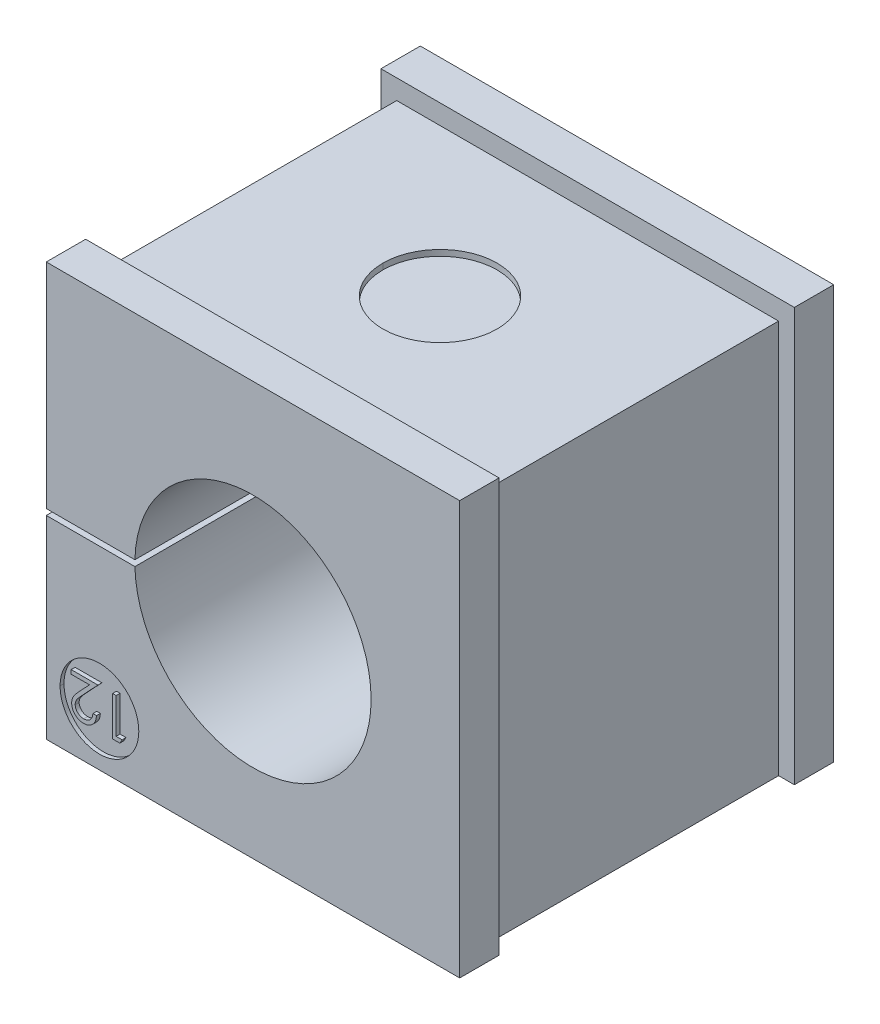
ISO-10303-21;
HEADER;
FILE_DESCRIPTION(('STEP AP214'),'2;1');
FILE_NAME('part.step','',(''),(''),'','','');
FILE_SCHEMA(('AUTOMOTIVE_DESIGN { 1 0 10303 214 1 1 1 1 }'));
ENDSEC;
DATA;
#1=APPLICATION_CONTEXT('core data for automotive mechanical design processes');
#2=APPLICATION_PROTOCOL_DEFINITION('international standard','automotive_design',2000,#1);
#3=PRODUCT_CONTEXT('',#1,'mechanical');
#4=PRODUCT('Part','Part','',(#3));
#5=PRODUCT_RELATED_PRODUCT_CATEGORY('part','',(#4));
#6=PRODUCT_DEFINITION_FORMATION('','',#4);
#7=PRODUCT_DEFINITION_CONTEXT('part definition',#1,'design');
#8=PRODUCT_DEFINITION('design','',#6,#7);
#9=PRODUCT_DEFINITION_SHAPE('','',#8);
#10=(LENGTH_UNIT() NAMED_UNIT(*) SI_UNIT(.MILLI.,.METRE.));
#11=(NAMED_UNIT(*) PLANE_ANGLE_UNIT() SI_UNIT($,.RADIAN.));
#12=(NAMED_UNIT(*) SI_UNIT($,.STERADIAN.) SOLID_ANGLE_UNIT());
#13=UNCERTAINTY_MEASURE_WITH_UNIT(LENGTH_MEASURE(1.E-05),#10,'distance_accuracy_value','');
#14=(GEOMETRIC_REPRESENTATION_CONTEXT(3) GLOBAL_UNCERTAINTY_ASSIGNED_CONTEXT((#13)) GLOBAL_UNIT_ASSIGNED_CONTEXT((#10,
#11,#12)) REPRESENTATION_CONTEXT('',''));
#15=CARTESIAN_POINT('',(0.,0.,0.));
#16=DIRECTION('',(0.,0.,1.));
#17=DIRECTION('',(1.,0.,0.));
#18=AXIS2_PLACEMENT_3D('',#15,#16,#17);
#19=CARTESIAN_POINT('',(2.23197146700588,-8.51484086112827,9.5));
#20=DIRECTION('',(0.,-3.68235546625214E-13,-1.));
#21=DIRECTION('',(0.,-1.,3.68235546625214E-13));
#22=AXIS2_PLACEMENT_3D('',#19,#20,#21);
#23=PLANE('',#22);
#24=CARTESIAN_POINT('',(1.903125,-8.64615384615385,9.5));
#25=CARTESIAN_POINT('',(1.91876947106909,-8.64576150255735,9.5));
#26=CARTESIAN_POINT('',(1.94949262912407,-8.64499100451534,9.5));
#27=CARTESIAN_POINT('',(1.99450409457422,-8.63915126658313,9.5));
#28=CARTESIAN_POINT('',(2.0377441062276,-8.63030728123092,9.5));
#29=CARTESIAN_POINT('',(2.07854634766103,-8.61622772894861,9.5));
#30=CARTESIAN_POINT('',(2.11776473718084,-8.59974945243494,9.5));
#31=CARTESIAN_POINT('',(2.15439879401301,-8.57841298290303,9.5));
#32=CARTESIAN_POINT('',(2.18947761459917,-8.55403276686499,9.5));
#33=CARTESIAN_POINT('',(2.22229592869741,-8.52560698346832,9.5));
#34=CARTESIAN_POINT('',(2.2521863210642,-8.49351855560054,9.5));
#35=CARTESIAN_POINT('',(2.27937787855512,-8.45859086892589,9.5));
#36=CARTESIAN_POINT('',(2.30241755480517,-8.42020472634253,9.5));
#37=CARTESIAN_POINT('',(2.32286964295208,-8.37928121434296,9.5));
#38=CARTESIAN_POINT('',(2.33851145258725,-8.33469599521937,9.5));
#39=CARTESIAN_POINT('',(2.35188407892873,-8.287539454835,9.5));
#40=CARTESIAN_POINT('',(2.36159776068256,-8.23713878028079,9.5));
#41=CARTESIAN_POINT('',(2.36494896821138,-8.20241396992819,9.5));
#42=CARTESIAN_POINT('',(2.36666666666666,-8.18461538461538,9.5));
#43=(BOUNDED_CURVE() B_SPLINE_CURVE(3,(#24,#25,#26,#27,#28,#29,#30,#31,#32,#33,#34,#35,#36,#37,
#38,#39,#40,#41,#42),.UNSPECIFIED.,.F.,.F.) B_SPLINE_CURVE_WITH_KNOTS((4,1,1,1,1,1,1,1,1,1,1,1,
1,1,1,1,4),(0.,0.0644420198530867,0.126553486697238,0.186778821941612,0.245943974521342,
0.304110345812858,0.361785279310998,0.42025540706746,0.479942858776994,0.540286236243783,
0.600712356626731,0.661962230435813,0.724472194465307,0.788881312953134,0.856306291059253,
0.926348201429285,1.),
.UNSPECIFIED.) CURVE() GEOMETRIC_REPRESENTATION_ITEM() RATIONAL_B_SPLINE_CURVE((1.,1.,1.,1.,1.,
1.,1.,1.,1.,1.,1.,1.,1.,1.,1.,1.,1.,1.,1.)) REPRESENTATION_ITEM(''));
#44=CARTESIAN_POINT('',(1.903125,-8.64615384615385,9.5));
#45=VERTEX_POINT('',#44);
#46=CARTESIAN_POINT('',(2.36666666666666,-8.18461538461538,9.5));
#47=VERTEX_POINT('',#46);
#48=EDGE_CURVE('E323',#45,#47,#43,.T.);
#49=ORIENTED_EDGE('',*,*,#48,.F.);
#50=CARTESIAN_POINT('',(1.46923076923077,-8.24070512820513,9.5));
#51=CARTESIAN_POINT('',(1.46959031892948,-8.25435314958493,9.5));
#52=CARTESIAN_POINT('',(1.47029892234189,-8.28125077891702,9.5));
#53=CARTESIAN_POINT('',(1.47667114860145,-8.32066100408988,9.5));
#54=CARTESIAN_POINT('',(1.48603321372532,-8.35882416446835,9.5));
#55=CARTESIAN_POINT('',(1.5004630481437,-8.39526839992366,9.5));
#56=CARTESIAN_POINT('',(1.51779996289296,-8.43071049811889,9.5));
#57=CARTESIAN_POINT('',(1.53994914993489,-8.46407290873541,9.5));
#58=CARTESIAN_POINT('',(1.5652598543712,-8.49649287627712,9.5));
#59=CARTESIAN_POINT('',(1.59461903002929,-8.52685874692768,9.5));
#60=CARTESIAN_POINT('',(1.62684994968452,-8.55467859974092,9.5));
#61=CARTESIAN_POINT('',(1.66090491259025,-8.57932040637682,9.5));
#62=CARTESIAN_POINT('',(1.69693325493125,-8.59991432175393,9.5));
#63=CARTESIAN_POINT('',(1.73478483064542,-8.6167962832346,9.5));
#64=CARTESIAN_POINT('',(1.77435364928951,-8.6300393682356,9.5));
#65=CARTESIAN_POINT('',(1.8157163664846,-8.63921569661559,9.5));
#66=CARTESIAN_POINT('',(1.85875865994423,-8.64497711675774,9.5));
#67=CARTESIAN_POINT('',(1.88814922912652,-8.64575664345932,9.5));
#68=CARTESIAN_POINT('',(1.903125,-8.64615384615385,9.5));
#69=(BOUNDED_CURVE() B_SPLINE_CURVE(3,(#50,#51,#52,#53,#54,#55,#56,#57,#58,#59,#60,#61,#62,#63,
#64,#65,#66,#67,#68),.UNSPECIFIED.,.F.,.F.) B_SPLINE_CURVE_WITH_KNOTS((4,1,1,1,1,1,1,1,1,1,1,1,
1,1,1,1,4),(0.,0.0619690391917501,0.122129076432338,0.18099912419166,0.240162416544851,
0.299864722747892,0.359951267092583,0.421741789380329,0.486545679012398,0.551508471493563,
0.614994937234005,0.677239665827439,0.739714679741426,0.803038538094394,0.866487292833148,
0.931969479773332,1.),
.UNSPECIFIED.) CURVE() GEOMETRIC_REPRESENTATION_ITEM() RATIONAL_B_SPLINE_CURVE((1.,1.,1.,1.,1.,
1.,1.,1.,1.,1.,1.,1.,1.,1.,1.,1.,1.,1.,1.)) REPRESENTATION_ITEM(''));
#70=CARTESIAN_POINT('',(1.46923076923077,-8.24070512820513,9.5));
#71=VERTEX_POINT('',#70);
#72=EDGE_CURVE('E409',#71,#45,#69,.T.);
#73=ORIENTED_EDGE('',*,*,#72,.F.);
#74=CARTESIAN_POINT('',(1.8474358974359,-7.62772435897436,9.5));
#75=CARTESIAN_POINT('',(1.82855005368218,-7.64743660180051,9.5));
#76=CARTESIAN_POINT('',(1.79227421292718,-7.68529978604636,9.5));
#77=CARTESIAN_POINT('',(1.74098747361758,-7.74059562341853,9.5));
#78=CARTESIAN_POINT('',(1.69484963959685,-7.79183410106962,9.5));
#79=CARTESIAN_POINT('',(1.65383010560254,-7.8392422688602,9.5));
#80=CARTESIAN_POINT('',(1.61789512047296,-7.88255136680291,9.5));
#81=CARTESIAN_POINT('',(1.58715966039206,-7.92210079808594,9.5));
#82=CARTESIAN_POINT('',(1.56148788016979,-7.95755116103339,9.5));
#83=CARTESIAN_POINT('',(1.53428114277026,-7.99919676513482,9.5));
#84=CARTESIAN_POINT('',(1.5083377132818,-8.05010392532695,9.5));
#85=CARTESIAN_POINT('',(1.48553609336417,-8.11200220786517,9.5));
#86=CARTESIAN_POINT('',(1.47173230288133,-8.1758625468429,9.5));
#87=CARTESIAN_POINT('',(1.47006795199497,-8.21900440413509,9.5));
#88=CARTESIAN_POINT('',(1.46923076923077,-8.24070512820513,9.5));
#89=(BOUNDED_CURVE() B_SPLINE_CURVE(3,(#74,#75,#76,#77,#78,#79,#80,#81,#82,#83,#84,#85,#86,#87,
#88),.UNSPECIFIED.,.F.,.F.) B_SPLINE_CURVE_WITH_KNOTS((4,1,1,1,1,1,1,1,1,1,1,1,4),(0.,
0.110794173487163,0.212812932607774,0.306077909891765,0.390617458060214,0.467232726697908,
0.534450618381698,0.593866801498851,0.644832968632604,0.736220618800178,0.825037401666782,
0.911992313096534,1.),
.UNSPECIFIED.) CURVE() GEOMETRIC_REPRESENTATION_ITEM() RATIONAL_B_SPLINE_CURVE((1.,1.,1.,1.,1.,
1.,1.,1.,1.,1.,1.,1.,1.,1.,1.)) REPRESENTATION_ITEM(''));
#90=CARTESIAN_POINT('',(1.8474358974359,-7.62772435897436,9.5));
#91=VERTEX_POINT('',#90);
#92=EDGE_CURVE('E421',#91,#71,#89,.T.);
#93=ORIENTED_EDGE('',*,*,#92,.F.);
#94=DIRECTION('',(-0.683776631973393,-0.729691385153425,0.));
#95=VECTOR('',#94,1.);
#96=CARTESIAN_POINT('',(2.62307692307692,-6.8,9.5));
#97=LINE('',#96,#95);
#98=CARTESIAN_POINT('',(2.62307692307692,-6.8,9.5));
#99=VERTEX_POINT('',#98);
#100=EDGE_CURVE('E370',#99,#91,#97,.T.);
#101=ORIENTED_EDGE('',*,*,#100,.F.);
#102=DIRECTION('',(1.,0.,0.));
#103=VECTOR('',#102,1.);
#104=CARTESIAN_POINT('',(1.26410256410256,-6.8,9.5));
#105=LINE('',#104,#103);
#106=CARTESIAN_POINT('',(1.26410256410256,-6.8,9.5));
#107=VERTEX_POINT('',#106);
#108=EDGE_CURVE('E369',#107,#99,#105,.T.);
#109=ORIENTED_EDGE('',*,*,#108,.F.);
#110=DIRECTION('',(0.,1.,0.));
#111=VECTOR('',#110,1.);
#112=CARTESIAN_POINT('',(1.26410256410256,-7.0051282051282,9.5));
#113=LINE('',#112,#111);
#114=CARTESIAN_POINT('',(1.26410256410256,-7.0051282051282,9.5));
#115=VERTEX_POINT('',#114);
#116=EDGE_CURVE('E254',#115,#107,#113,.T.);
#117=ORIENTED_EDGE('',*,*,#116,.F.);
#118=DIRECTION('',(-1.,0.,0.));
#119=VECTOR('',#118,1.);
#120=CARTESIAN_POINT('',(2.19479166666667,-7.0051282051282,9.5));
#121=LINE('',#120,#119);
#122=CARTESIAN_POINT('',(2.19479166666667,-7.0051282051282,9.5));
#123=VERTEX_POINT('',#122);
#124=EDGE_CURVE('E251',#123,#115,#121,.T.);
#125=ORIENTED_EDGE('',*,*,#124,.F.);
#126=DIRECTION('',(0.683740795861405,0.729724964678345,0.));
#127=VECTOR('',#126,1.);
#128=CARTESIAN_POINT('',(1.69439102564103,-7.53918269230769,9.5));
#129=LINE('',#128,#127);
#130=CARTESIAN_POINT('',(1.69439102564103,-7.53918269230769,9.5));
#131=VERTEX_POINT('',#130);
#132=EDGE_CURVE('E235',#131,#123,#129,.T.);
#133=ORIENTED_EDGE('',*,*,#132,.F.);
#134=CARTESIAN_POINT('',(1.28974358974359,-8.25673076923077,9.5));
#135=CARTESIAN_POINT('',(1.29071118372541,-8.2288748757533,9.5));
#136=CARTESIAN_POINT('',(1.29262939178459,-8.17365192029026,9.5));
#137=CARTESIAN_POINT('',(1.30903738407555,-8.092500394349,9.5));
#138=CARTESIAN_POINT('',(1.33466481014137,-8.01387625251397,9.5));
#139=CARTESIAN_POINT('',(1.36551770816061,-7.95059563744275,9.5));
#140=CARTESIAN_POINT('',(1.39665093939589,-7.8996098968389,9.5));
#141=CARTESIAN_POINT('',(1.42467844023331,-7.85761003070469,9.5));
#142=CARTESIAN_POINT('',(1.45767586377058,-7.81239936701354,9.5));
#143=CARTESIAN_POINT('',(1.49536129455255,-7.76379491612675,9.5));
#144=CARTESIAN_POINT('',(1.53838372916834,-7.71243319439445,9.5));
#145=CARTESIAN_POINT('',(1.58562545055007,-7.65726628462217,9.5));
#146=CARTESIAN_POINT('',(1.6383064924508,-7.59931426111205,9.5));
#147=CARTESIAN_POINT('',(1.67524856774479,-7.55970646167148,9.5));
#148=CARTESIAN_POINT('',(1.69439102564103,-7.53918269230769,9.5));
#149=(BOUNDED_CURVE() B_SPLINE_CURVE(3,(#134,#135,#136,#137,#138,#139,#140,#141,#142,#143,#144,
#145,#146,#147,#148),.UNSPECIFIED.,.F.,.F.) B_SPLINE_CURVE_WITH_KNOTS((4,1,1,1,1,1,1,1,1,1,1,1,
4),(0.,0.098701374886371,0.195670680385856,0.292419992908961,0.391339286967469,
0.444458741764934,0.504224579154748,0.570347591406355,0.642913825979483,0.722289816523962,
0.807922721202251,0.900470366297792,1.),
.UNSPECIFIED.) CURVE() GEOMETRIC_REPRESENTATION_ITEM() RATIONAL_B_SPLINE_CURVE((1.,1.,1.,1.,1.,
1.,1.,1.,1.,1.,1.,1.,1.,1.,1.)) REPRESENTATION_ITEM(''));
#150=CARTESIAN_POINT('',(1.28974358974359,-8.25673076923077,9.5));
#151=VERTEX_POINT('',#150);
#152=EDGE_CURVE('E322',#151,#131,#149,.T.);
#153=ORIENTED_EDGE('',*,*,#152,.F.);
#154=CARTESIAN_POINT('',(1.89391025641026,-8.85128205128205,9.5));
#155=CARTESIAN_POINT('',(1.87197838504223,-8.85077281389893,9.5));
#156=CARTESIAN_POINT('',(1.82888304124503,-8.84977218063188,9.5));
#157=CARTESIAN_POINT('',(1.76601229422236,-8.84104979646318,9.5));
#158=CARTESIAN_POINT('',(1.70601852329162,-8.82768352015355,9.5));
#159=CARTESIAN_POINT('',(1.64958163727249,-8.80787680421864,9.5));
#160=CARTESIAN_POINT('',(1.5961224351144,-8.78302370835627,9.5));
#161=CARTESIAN_POINT('',(1.54630283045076,-8.75211562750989,9.5));
#162=CARTESIAN_POINT('',(1.49891813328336,-8.71661502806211,9.5));
#163=CARTESIAN_POINT('',(1.45629390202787,-8.67474033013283,9.5));
#164=CARTESIAN_POINT('',(1.41713840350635,-8.63005992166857,9.5));
#165=CARTESIAN_POINT('',(1.38338873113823,-8.58234162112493,9.5));
#166=CARTESIAN_POINT('',(1.35432324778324,-8.53299942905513,9.5));
#167=CARTESIAN_POINT('',(1.33053405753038,-8.48164791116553,9.5));
#168=CARTESIAN_POINT('',(1.31250079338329,-8.428119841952,9.5));
#169=CARTESIAN_POINT('',(1.29913987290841,-8.37292841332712,9.5));
#170=CARTESIAN_POINT('',(1.29150204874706,-8.31543667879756,9.5));
#171=CARTESIAN_POINT('',(1.29033627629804,-8.27651752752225,9.5));
#172=CARTESIAN_POINT('',(1.28974358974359,-8.25673076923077,9.5));
#173=(BOUNDED_CURVE() B_SPLINE_CURVE(3,(#154,#155,#156,#157,#158,#159,#160,#161,#162,#163,#164,
#165,#166,#167,#168,#169,#170,#171,#172),.UNSPECIFIED.,.F.,.F.) B_SPLINE_CURVE_WITH_KNOTS((4,1,
1,1,1,1,1,1,1,1,1,1,1,1,1,1,4),(0.,0.0694796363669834,0.136525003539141,0.200800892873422,
0.263983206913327,0.325711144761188,0.38727051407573,0.449492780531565,0.51295519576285,
0.576266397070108,0.637574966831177,0.697901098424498,0.757558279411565,0.816587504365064,
0.876645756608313,0.937285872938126,1.),
.UNSPECIFIED.) CURVE() GEOMETRIC_REPRESENTATION_ITEM() RATIONAL_B_SPLINE_CURVE((1.,1.,1.,1.,1.,
1.,1.,1.,1.,1.,1.,1.,1.,1.,1.,1.,1.,1.,1.)) REPRESENTATION_ITEM(''));
#174=CARTESIAN_POINT('',(1.89391025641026,-8.85128205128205,9.5));
#175=VERTEX_POINT('',#174);
#176=EDGE_CURVE('E321',#175,#151,#173,.T.);
#177=ORIENTED_EDGE('',*,*,#176,.F.);
#178=CARTESIAN_POINT('',(2.54615384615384,-8.18461538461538,9.5));
#179=CARTESIAN_POINT('',(2.54498424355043,-8.20842743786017,9.5));
#180=CARTESIAN_POINT('',(2.54268717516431,-8.25519367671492,9.5));
#181=CARTESIAN_POINT('',(2.53192533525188,-8.32337710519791,9.5));
#182=CARTESIAN_POINT('',(2.51654074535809,-8.38855728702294,9.5));
#183=CARTESIAN_POINT('',(2.49473719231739,-8.4501754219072,9.5));
#184=CARTESIAN_POINT('',(2.46781170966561,-8.50896759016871,9.5));
#185=CARTESIAN_POINT('',(2.43484712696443,-8.56415309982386,9.5));
#186=CARTESIAN_POINT('',(2.39654619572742,-8.61627966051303,9.5));
#187=CARTESIAN_POINT('',(2.35297918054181,-8.66436034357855,9.5));
#188=CARTESIAN_POINT('',(2.30570495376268,-8.70831209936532,9.5));
#189=CARTESIAN_POINT('',(2.25500676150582,-8.74666833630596,9.5));
#190=CARTESIAN_POINT('',(2.20140568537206,-8.77870482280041,9.5));
#191=CARTESIAN_POINT('',(2.1453666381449,-8.80563222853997,9.5));
#192=CARTESIAN_POINT('',(2.08624151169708,-8.82581997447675,9.5));
#193=CARTESIAN_POINT('',(2.02459547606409,-8.84080552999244,9.5));
#194=CARTESIAN_POINT('',(1.96014989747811,-8.84982010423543,9.5));
#195=CARTESIAN_POINT('',(1.91624136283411,-8.85078919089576,9.5));
#196=CARTESIAN_POINT('',(1.89391025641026,-8.85128205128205,9.5));
#197=(BOUNDED_CURVE() B_SPLINE_CURVE(3,(#178,#179,#180,#181,#182,#183,#184,#185,#186,#187,#188,
#189,#190,#191,#192,#193,#194,#195,#196),.UNSPECIFIED.,.F.,.F.) B_SPLINE_CURVE_WITH_KNOTS((4,1,
1,1,1,1,1,1,1,1,1,1,1,1,1,1,4),(0.,0.0687985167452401,0.135118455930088,0.199001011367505,
0.261933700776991,0.323531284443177,0.385434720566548,0.447215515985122,0.510018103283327,
0.572510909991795,0.633364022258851,0.693216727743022,0.752555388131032,0.81255822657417,
0.873260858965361,0.935542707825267,1.),
.UNSPECIFIED.) CURVE() GEOMETRIC_REPRESENTATION_ITEM() RATIONAL_B_SPLINE_CURVE((1.,1.,1.,1.,1.,
1.,1.,1.,1.,1.,1.,1.,1.,1.,1.,1.,1.,1.,1.)) REPRESENTATION_ITEM(''));
#198=CARTESIAN_POINT('',(2.54615384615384,-8.18461538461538,9.5));
#199=VERTEX_POINT('',#198);
#200=EDGE_CURVE('E24',#199,#175,#197,.T.);
#201=ORIENTED_EDGE('',*,*,#200,.F.);
#202=DIRECTION('',(1.,0.,0.));
#203=VECTOR('',#202,1.);
#204=CARTESIAN_POINT('',(2.36666666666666,-8.18461538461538,9.5));
#205=LINE('',#204,#203);
#206=EDGE_CURVE('E9',#47,#199,#205,.T.);
#207=ORIENTED_EDGE('',*,*,#206,.F.);
#208=EDGE_LOOP('',(#49,#73,#93,#101,#109,#117,#125,#133,#153,#177,#201,#207));
#209=FACE_BOUND('',#208,.T.);
#210=ADVANCED_FACE('F15',(#209),#23,.F.);
#211=CARTESIAN_POINT('',(2.36666666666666,-8.18461538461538,9.5));
#212=DIRECTION('',(0.,1.,0.));
#213=DIRECTION('',(1.,0.,0.));
#214=AXIS2_PLACEMENT_3D('',#211,#212,#213);
#215=PLANE('',#214);
#216=DIRECTION('',(1.,0.,0.));
#217=VECTOR('',#216,1.);
#218=CARTESIAN_POINT('',(2.36666666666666,-8.18461538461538,9.3));
#219=LINE('',#218,#217);
#220=CARTESIAN_POINT('',(2.36666666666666,-8.18461538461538,9.3));
#221=VERTEX_POINT('',#220);
#222=CARTESIAN_POINT('',(2.54615384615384,-8.18461538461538,9.3));
#223=VERTEX_POINT('',#222);
#224=EDGE_CURVE('E303',#221,#223,#219,.T.);
#225=ORIENTED_EDGE('',*,*,#224,.F.);
#226=DIRECTION('',(0.,0.,-1.));
#227=VECTOR('',#226,1.);
#228=CARTESIAN_POINT('',(2.36666666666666,-8.18461538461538,9.5));
#229=LINE('',#228,#227);
#230=EDGE_CURVE('E329',#47,#221,#229,.T.);
#231=ORIENTED_EDGE('',*,*,#230,.F.);
#232=ORIENTED_EDGE('',*,*,#206,.T.);
#233=DIRECTION('',(0.,0.,-1.));
#234=VECTOR('',#233,1.);
#235=CARTESIAN_POINT('',(2.54615384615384,-8.18461538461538,9.5));
#236=LINE('',#235,#234);
#237=EDGE_CURVE('E436',#199,#223,#236,.T.);
#238=ORIENTED_EDGE('',*,*,#237,.T.);
#239=EDGE_LOOP('',(#225,#231,#232,#238));
#240=FACE_BOUND('',#239,.T.);
#241=ADVANCED_FACE('F870',(#240),#215,.T.);
#242=CARTESIAN_POINT('',(2.54615384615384,-8.18461538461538,9.5));
#243=CARTESIAN_POINT('',(2.54615384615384,-8.18461538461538,9.3));
#244=CARTESIAN_POINT('',(2.54498424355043,-8.20842743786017,9.5));
#245=CARTESIAN_POINT('',(2.54498424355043,-8.20842743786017,9.3));
#246=CARTESIAN_POINT('',(2.54268717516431,-8.25519367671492,9.5));
#247=CARTESIAN_POINT('',(2.54268717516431,-8.25519367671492,9.3));
#248=CARTESIAN_POINT('',(2.53192533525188,-8.32337710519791,9.5));
#249=CARTESIAN_POINT('',(2.53192533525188,-8.32337710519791,9.3));
#250=CARTESIAN_POINT('',(2.51654074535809,-8.38855728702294,9.5));
#251=CARTESIAN_POINT('',(2.51654074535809,-8.38855728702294,9.3));
#252=CARTESIAN_POINT('',(2.49473719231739,-8.4501754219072,9.5));
#253=CARTESIAN_POINT('',(2.49473719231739,-8.4501754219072,9.3));
#254=CARTESIAN_POINT('',(2.46781170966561,-8.50896759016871,9.5));
#255=CARTESIAN_POINT('',(2.46781170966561,-8.50896759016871,9.3));
#256=CARTESIAN_POINT('',(2.43484712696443,-8.56415309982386,9.5));
#257=CARTESIAN_POINT('',(2.43484712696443,-8.56415309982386,9.3));
#258=CARTESIAN_POINT('',(2.39654619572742,-8.61627966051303,9.5));
#259=CARTESIAN_POINT('',(2.39654619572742,-8.61627966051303,9.3));
#260=CARTESIAN_POINT('',(2.35297918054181,-8.66436034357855,9.5));
#261=CARTESIAN_POINT('',(2.35297918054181,-8.66436034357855,9.3));
#262=CARTESIAN_POINT('',(2.30570495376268,-8.70831209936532,9.5));
#263=CARTESIAN_POINT('',(2.30570495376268,-8.70831209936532,9.3));
#264=CARTESIAN_POINT('',(2.25500676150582,-8.74666833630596,9.5));
#265=CARTESIAN_POINT('',(2.25500676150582,-8.74666833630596,9.3));
#266=CARTESIAN_POINT('',(2.20140568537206,-8.77870482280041,9.5));
#267=CARTESIAN_POINT('',(2.20140568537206,-8.77870482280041,9.3));
#268=CARTESIAN_POINT('',(2.1453666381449,-8.80563222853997,9.5));
#269=CARTESIAN_POINT('',(2.1453666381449,-8.80563222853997,9.3));
#270=CARTESIAN_POINT('',(2.08624151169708,-8.82581997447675,9.5));
#271=CARTESIAN_POINT('',(2.08624151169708,-8.82581997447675,9.3));
#272=CARTESIAN_POINT('',(2.02459547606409,-8.84080552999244,9.5));
#273=CARTESIAN_POINT('',(2.02459547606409,-8.84080552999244,9.3));
#274=CARTESIAN_POINT('',(1.96014989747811,-8.84982010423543,9.5));
#275=CARTESIAN_POINT('',(1.96014989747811,-8.84982010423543,9.3));
#276=CARTESIAN_POINT('',(1.91624136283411,-8.85078919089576,9.5));
#277=CARTESIAN_POINT('',(1.91624136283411,-8.85078919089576,9.3));
#278=CARTESIAN_POINT('',(1.89391025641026,-8.85128205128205,9.5));
#279=CARTESIAN_POINT('',(1.89391025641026,-8.85128205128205,9.3));
#280=(BOUNDED_SURFACE() B_SPLINE_SURFACE(3,1,((#242,#243),(#244,#245),(#246,#247),(#248,#249),
(#250,#251),(#252,#253),(#254,#255),(#256,#257),(#258,#259),(#260,#261),(#262,#263),(#264,#265),
(#266,#267),(#268,#269),(#270,#271),(#272,#273),(#274,#275),(#276,#277),(#278,#279)),
.UNSPECIFIED.,.F.,.F.,.F.) B_SPLINE_SURFACE_WITH_KNOTS((4,1,1,1,1,1,1,1,1,1,1,1,1,1,1,1,4),(2,
2),(0.,0.0687985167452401,0.135118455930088,0.199001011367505,0.261933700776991,
0.323531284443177,0.385434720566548,0.447215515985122,0.510018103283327,0.572510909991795,
0.633364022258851,0.693216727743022,0.752555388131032,0.81255822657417,0.873260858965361,
0.935542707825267,1.),(0.,1.),
.UNSPECIFIED.) GEOMETRIC_REPRESENTATION_ITEM() RATIONAL_B_SPLINE_SURFACE(((1.,1.),(1.,1.),(1.,
1.),(1.,1.),(1.,1.),(1.,1.),(1.,1.),(1.,1.),(1.,1.),(1.,1.),(1.,1.),(1.,1.),(1.,1.),(1.,1.),(1.,
1.),(1.,1.),(1.,1.),(1.,1.),(1.,1.))) REPRESENTATION_ITEM('') SURFACE());
#281=CARTESIAN_POINT('',(2.54615384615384,-8.18461538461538,9.3));
#282=CARTESIAN_POINT('',(2.54498424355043,-8.20842743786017,9.3));
#283=CARTESIAN_POINT('',(2.54268717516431,-8.25519367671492,9.3));
#284=CARTESIAN_POINT('',(2.53192533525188,-8.32337710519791,9.3));
#285=CARTESIAN_POINT('',(2.51654074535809,-8.38855728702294,9.3));
#286=CARTESIAN_POINT('',(2.49473719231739,-8.4501754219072,9.3));
#287=CARTESIAN_POINT('',(2.46781170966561,-8.50896759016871,9.3));
#288=CARTESIAN_POINT('',(2.43484712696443,-8.56415309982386,9.3));
#289=CARTESIAN_POINT('',(2.39654619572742,-8.61627966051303,9.3));
#290=CARTESIAN_POINT('',(2.35297918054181,-8.66436034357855,9.3));
#291=CARTESIAN_POINT('',(2.30570495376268,-8.70831209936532,9.3));
#292=CARTESIAN_POINT('',(2.25500676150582,-8.74666833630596,9.3));
#293=CARTESIAN_POINT('',(2.20140568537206,-8.77870482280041,9.3));
#294=CARTESIAN_POINT('',(2.1453666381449,-8.80563222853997,9.3));
#295=CARTESIAN_POINT('',(2.08624151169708,-8.82581997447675,9.3));
#296=CARTESIAN_POINT('',(2.02459547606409,-8.84080552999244,9.3));
#297=CARTESIAN_POINT('',(1.96014989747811,-8.84982010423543,9.3));
#298=CARTESIAN_POINT('',(1.91624136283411,-8.85078919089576,9.3));
#299=CARTESIAN_POINT('',(1.89391025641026,-8.85128205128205,9.3));
#300=(BOUNDED_CURVE() B_SPLINE_CURVE(3,(#281,#282,#283,#284,#285,#286,#287,#288,#289,#290,#291,
#292,#293,#294,#295,#296,#297,#298,#299),.UNSPECIFIED.,.F.,.F.) B_SPLINE_CURVE_WITH_KNOTS((4,1,
1,1,1,1,1,1,1,1,1,1,1,1,1,1,4),(0.,0.0687985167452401,0.135118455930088,0.199001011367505,
0.261933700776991,0.323531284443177,0.385434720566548,0.447215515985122,0.510018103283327,
0.572510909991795,0.633364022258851,0.693216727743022,0.752555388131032,0.81255822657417,
0.873260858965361,0.935542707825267,1.),
.UNSPECIFIED.) CURVE() GEOMETRIC_REPRESENTATION_ITEM() RATIONAL_B_SPLINE_CURVE((1.,1.,1.,1.,1.,
1.,1.,1.,1.,1.,1.,1.,1.,1.,1.,1.,1.,1.,1.)) REPRESENTATION_ITEM(''));
#301=CARTESIAN_POINT('',(1.89391025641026,-8.85128205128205,9.3));
#302=VERTEX_POINT('',#301);
#303=EDGE_CURVE('E305',#223,#302,#300,.T.);
#304=DIRECTION('',(0.,0.,-1.));
#305=VECTOR('',#304,1.);
#306=CARTESIAN_POINT('',(1.89391025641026,-8.85128205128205,9.5));
#307=LINE('',#306,#305);
#308=EDGE_CURVE('E315',#175,#302,#307,.T.);
#309=ORIENTED_EDGE('',*,*,#303,.F.);
#310=ORIENTED_EDGE('',*,*,#237,.F.);
#311=ORIENTED_EDGE('',*,*,#200,.T.);
#312=ORIENTED_EDGE('',*,*,#308,.T.);
#313=EDGE_LOOP('',(#309,#310,#311,#312));
#314=FACE_BOUND('',#313,.T.);
#315=ADVANCED_FACE('F868',(#314),#280,.T.);
#316=CARTESIAN_POINT('',(1.89391025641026,-8.85128205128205,9.5));
#317=CARTESIAN_POINT('',(1.89391025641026,-8.85128205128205,9.3));
#318=CARTESIAN_POINT('',(1.87197838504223,-8.85077281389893,9.5));
#319=CARTESIAN_POINT('',(1.87197838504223,-8.85077281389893,9.3));
#320=CARTESIAN_POINT('',(1.82888304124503,-8.84977218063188,9.5));
#321=CARTESIAN_POINT('',(1.82888304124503,-8.84977218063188,9.3));
#322=CARTESIAN_POINT('',(1.76601229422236,-8.84104979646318,9.5));
#323=CARTESIAN_POINT('',(1.76601229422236,-8.84104979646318,9.3));
#324=CARTESIAN_POINT('',(1.70601852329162,-8.82768352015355,9.5));
#325=CARTESIAN_POINT('',(1.70601852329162,-8.82768352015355,9.3));
#326=CARTESIAN_POINT('',(1.64958163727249,-8.80787680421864,9.5));
#327=CARTESIAN_POINT('',(1.64958163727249,-8.80787680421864,9.3));
#328=CARTESIAN_POINT('',(1.5961224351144,-8.78302370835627,9.5));
#329=CARTESIAN_POINT('',(1.5961224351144,-8.78302370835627,9.3));
#330=CARTESIAN_POINT('',(1.54630283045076,-8.75211562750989,9.5));
#331=CARTESIAN_POINT('',(1.54630283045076,-8.75211562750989,9.3));
#332=CARTESIAN_POINT('',(1.49891813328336,-8.71661502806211,9.5));
#333=CARTESIAN_POINT('',(1.49891813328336,-8.71661502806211,9.3));
#334=CARTESIAN_POINT('',(1.45629390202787,-8.67474033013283,9.5));
#335=CARTESIAN_POINT('',(1.45629390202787,-8.67474033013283,9.3));
#336=CARTESIAN_POINT('',(1.41713840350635,-8.63005992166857,9.5));
#337=CARTESIAN_POINT('',(1.41713840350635,-8.63005992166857,9.3));
#338=CARTESIAN_POINT('',(1.38338873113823,-8.58234162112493,9.5));
#339=CARTESIAN_POINT('',(1.38338873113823,-8.58234162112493,9.3));
#340=CARTESIAN_POINT('',(1.35432324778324,-8.53299942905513,9.5));
#341=CARTESIAN_POINT('',(1.35432324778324,-8.53299942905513,9.3));
#342=CARTESIAN_POINT('',(1.33053405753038,-8.48164791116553,9.5));
#343=CARTESIAN_POINT('',(1.33053405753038,-8.48164791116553,9.3));
#344=CARTESIAN_POINT('',(1.31250079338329,-8.428119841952,9.5));
#345=CARTESIAN_POINT('',(1.31250079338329,-8.428119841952,9.3));
#346=CARTESIAN_POINT('',(1.29913987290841,-8.37292841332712,9.5));
#347=CARTESIAN_POINT('',(1.29913987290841,-8.37292841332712,9.3));
#348=CARTESIAN_POINT('',(1.29150204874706,-8.31543667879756,9.5));
#349=CARTESIAN_POINT('',(1.29150204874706,-8.31543667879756,9.3));
#350=CARTESIAN_POINT('',(1.29033627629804,-8.27651752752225,9.5));
#351=CARTESIAN_POINT('',(1.29033627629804,-8.27651752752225,9.3));
#352=CARTESIAN_POINT('',(1.28974358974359,-8.25673076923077,9.5));
#353=CARTESIAN_POINT('',(1.28974358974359,-8.25673076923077,9.3));
#354=(BOUNDED_SURFACE() B_SPLINE_SURFACE(3,1,((#316,#317),(#318,#319),(#320,#321),(#322,#323),
(#324,#325),(#326,#327),(#328,#329),(#330,#331),(#332,#333),(#334,#335),(#336,#337),(#338,#339),
(#340,#341),(#342,#343),(#344,#345),(#346,#347),(#348,#349),(#350,#351),(#352,#353)),
.UNSPECIFIED.,.F.,.F.,.F.) B_SPLINE_SURFACE_WITH_KNOTS((4,1,1,1,1,1,1,1,1,1,1,1,1,1,1,1,4),(2,
2),(0.,0.0694796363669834,0.136525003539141,0.200800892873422,0.263983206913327,
0.325711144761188,0.38727051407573,0.449492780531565,0.51295519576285,0.576266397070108,
0.637574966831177,0.697901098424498,0.757558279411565,0.816587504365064,0.876645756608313,
0.937285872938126,1.),(0.,1.),
.UNSPECIFIED.) GEOMETRIC_REPRESENTATION_ITEM() RATIONAL_B_SPLINE_SURFACE(((1.,1.),(1.,1.),(1.,
1.),(1.,1.),(1.,1.),(1.,1.),(1.,1.),(1.,1.),(1.,1.),(1.,1.),(1.,1.),(1.,1.),(1.,1.),(1.,1.),(1.,
1.),(1.,1.),(1.,1.),(1.,1.),(1.,1.))) REPRESENTATION_ITEM('') SURFACE());
#355=CARTESIAN_POINT('',(1.89391025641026,-8.85128205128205,9.3));
#356=CARTESIAN_POINT('',(1.87197838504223,-8.85077281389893,9.3));
#357=CARTESIAN_POINT('',(1.82888304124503,-8.84977218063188,9.3));
#358=CARTESIAN_POINT('',(1.76601229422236,-8.84104979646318,9.3));
#359=CARTESIAN_POINT('',(1.70601852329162,-8.82768352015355,9.3));
#360=CARTESIAN_POINT('',(1.64958163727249,-8.80787680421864,9.3));
#361=CARTESIAN_POINT('',(1.5961224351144,-8.78302370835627,9.3));
#362=CARTESIAN_POINT('',(1.54630283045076,-8.75211562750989,9.3));
#363=CARTESIAN_POINT('',(1.49891813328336,-8.71661502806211,9.3));
#364=CARTESIAN_POINT('',(1.45629390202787,-8.67474033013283,9.3));
#365=CARTESIAN_POINT('',(1.41713840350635,-8.63005992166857,9.3));
#366=CARTESIAN_POINT('',(1.38338873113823,-8.58234162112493,9.3));
#367=CARTESIAN_POINT('',(1.35432324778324,-8.53299942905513,9.3));
#368=CARTESIAN_POINT('',(1.33053405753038,-8.48164791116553,9.3));
#369=CARTESIAN_POINT('',(1.31250079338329,-8.428119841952,9.3));
#370=CARTESIAN_POINT('',(1.29913987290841,-8.37292841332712,9.3));
#371=CARTESIAN_POINT('',(1.29150204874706,-8.31543667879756,9.3));
#372=CARTESIAN_POINT('',(1.29033627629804,-8.27651752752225,9.3));
#373=CARTESIAN_POINT('',(1.28974358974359,-8.25673076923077,9.3));
#374=(BOUNDED_CURVE() B_SPLINE_CURVE(3,(#355,#356,#357,#358,#359,#360,#361,#362,#363,#364,#365,
#366,#367,#368,#369,#370,#371,#372,#373),.UNSPECIFIED.,.F.,.F.) B_SPLINE_CURVE_WITH_KNOTS((4,1,
1,1,1,1,1,1,1,1,1,1,1,1,1,1,4),(0.,0.0694796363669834,0.136525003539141,0.200800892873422,
0.263983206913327,0.325711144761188,0.38727051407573,0.449492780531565,0.51295519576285,
0.576266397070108,0.637574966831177,0.697901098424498,0.757558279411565,0.816587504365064,
0.876645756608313,0.937285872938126,1.),
.UNSPECIFIED.) CURVE() GEOMETRIC_REPRESENTATION_ITEM() RATIONAL_B_SPLINE_CURVE((1.,1.,1.,1.,1.,
1.,1.,1.,1.,1.,1.,1.,1.,1.,1.,1.,1.,1.,1.)) REPRESENTATION_ITEM(''));
#375=CARTESIAN_POINT('',(1.28974358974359,-8.25673076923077,9.3));
#376=VERTEX_POINT('',#375);
#377=EDGE_CURVE('E314',#302,#376,#374,.T.);
#378=DIRECTION('',(0.,0.,-1.));
#379=VECTOR('',#378,1.);
#380=CARTESIAN_POINT('',(1.28974358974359,-8.25673076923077,9.5));
#381=LINE('',#380,#379);
#382=EDGE_CURVE('E248',#151,#376,#381,.T.);
#383=ORIENTED_EDGE('',*,*,#377,.F.);
#384=ORIENTED_EDGE('',*,*,#308,.F.);
#385=ORIENTED_EDGE('',*,*,#176,.T.);
#386=ORIENTED_EDGE('',*,*,#382,.T.);
#387=EDGE_LOOP('',(#383,#384,#385,#386));
#388=FACE_BOUND('',#387,.T.);
#389=ADVANCED_FACE('F866',(#388),#354,.T.);
#390=CARTESIAN_POINT('',(1.28974358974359,-8.25673076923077,9.5));
#391=CARTESIAN_POINT('',(1.28974358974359,-8.25673076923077,9.3));
#392=CARTESIAN_POINT('',(1.29071118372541,-8.2288748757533,9.5));
#393=CARTESIAN_POINT('',(1.29071118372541,-8.2288748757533,9.3));
#394=CARTESIAN_POINT('',(1.29262939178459,-8.17365192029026,9.5));
#395=CARTESIAN_POINT('',(1.29262939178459,-8.17365192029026,9.3));
#396=CARTESIAN_POINT('',(1.30903738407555,-8.092500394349,9.5));
#397=CARTESIAN_POINT('',(1.30903738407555,-8.092500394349,9.3));
#398=CARTESIAN_POINT('',(1.33466481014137,-8.01387625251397,9.5));
#399=CARTESIAN_POINT('',(1.33466481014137,-8.01387625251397,9.3));
#400=CARTESIAN_POINT('',(1.36551770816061,-7.95059563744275,9.5));
#401=CARTESIAN_POINT('',(1.36551770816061,-7.95059563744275,9.3));
#402=CARTESIAN_POINT('',(1.39665093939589,-7.8996098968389,9.5));
#403=CARTESIAN_POINT('',(1.39665093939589,-7.8996098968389,9.3));
#404=CARTESIAN_POINT('',(1.42467844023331,-7.85761003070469,9.5));
#405=CARTESIAN_POINT('',(1.42467844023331,-7.85761003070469,9.3));
#406=CARTESIAN_POINT('',(1.45767586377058,-7.81239936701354,9.5));
#407=CARTESIAN_POINT('',(1.45767586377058,-7.81239936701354,9.3));
#408=CARTESIAN_POINT('',(1.49536129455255,-7.76379491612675,9.5));
#409=CARTESIAN_POINT('',(1.49536129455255,-7.76379491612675,9.3));
#410=CARTESIAN_POINT('',(1.53838372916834,-7.71243319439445,9.5));
#411=CARTESIAN_POINT('',(1.53838372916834,-7.71243319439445,9.3));
#412=CARTESIAN_POINT('',(1.58562545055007,-7.65726628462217,9.5));
#413=CARTESIAN_POINT('',(1.58562545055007,-7.65726628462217,9.3));
#414=CARTESIAN_POINT('',(1.6383064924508,-7.59931426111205,9.5));
#415=CARTESIAN_POINT('',(1.6383064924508,-7.59931426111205,9.3));
#416=CARTESIAN_POINT('',(1.67524856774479,-7.55970646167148,9.5));
#417=CARTESIAN_POINT('',(1.67524856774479,-7.55970646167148,9.3));
#418=CARTESIAN_POINT('',(1.69439102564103,-7.53918269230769,9.5));
#419=CARTESIAN_POINT('',(1.69439102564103,-7.53918269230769,9.3));
#420=(BOUNDED_SURFACE() B_SPLINE_SURFACE(3,1,((#390,#391),(#392,#393),(#394,#395),(#396,#397),
(#398,#399),(#400,#401),(#402,#403),(#404,#405),(#406,#407),(#408,#409),(#410,#411),(#412,#413),
(#414,#415),(#416,#417),(#418,#419)),.UNSPECIFIED.,.F.,.F.,.F.) B_SPLINE_SURFACE_WITH_KNOTS((4,
1,1,1,1,1,1,1,1,1,1,1,4),(2,2),(0.,0.098701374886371,0.195670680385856,0.292419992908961,
0.391339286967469,0.444458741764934,0.504224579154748,0.570347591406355,0.642913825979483,
0.722289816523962,0.807922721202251,0.900470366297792,1.),(0.,1.),
.UNSPECIFIED.) GEOMETRIC_REPRESENTATION_ITEM() RATIONAL_B_SPLINE_SURFACE(((1.,1.),(1.,1.),(1.,
1.),(1.,1.),(1.,1.),(1.,1.),(1.,1.),(1.,1.),(1.,1.),(1.,1.),(1.,1.),(1.,1.),(1.,1.),(1.,1.),(1.,1.))) REPRESENTATION_ITEM('') SURFACE());
#421=CARTESIAN_POINT('',(1.28974358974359,-8.25673076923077,9.3));
#422=CARTESIAN_POINT('',(1.29071118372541,-8.2288748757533,9.3));
#423=CARTESIAN_POINT('',(1.29262939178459,-8.17365192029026,9.3));
#424=CARTESIAN_POINT('',(1.30903738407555,-8.092500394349,9.3));
#425=CARTESIAN_POINT('',(1.33466481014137,-8.01387625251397,9.3));
#426=CARTESIAN_POINT('',(1.36551770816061,-7.95059563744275,9.3));
#427=CARTESIAN_POINT('',(1.39665093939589,-7.8996098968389,9.3));
#428=CARTESIAN_POINT('',(1.42467844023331,-7.85761003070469,9.3));
#429=CARTESIAN_POINT('',(1.45767586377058,-7.81239936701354,9.3));
#430=CARTESIAN_POINT('',(1.49536129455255,-7.76379491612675,9.3));
#431=CARTESIAN_POINT('',(1.53838372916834,-7.71243319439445,9.3));
#432=CARTESIAN_POINT('',(1.58562545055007,-7.65726628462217,9.3));
#433=CARTESIAN_POINT('',(1.6383064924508,-7.59931426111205,9.3));
#434=CARTESIAN_POINT('',(1.67524856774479,-7.55970646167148,9.3));
#435=CARTESIAN_POINT('',(1.69439102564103,-7.53918269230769,9.3));
#436=(BOUNDED_CURVE() B_SPLINE_CURVE(3,(#421,#422,#423,#424,#425,#426,#427,#428,#429,#430,#431,
#432,#433,#434,#435),.UNSPECIFIED.,.F.,.F.) B_SPLINE_CURVE_WITH_KNOTS((4,1,1,1,1,1,1,1,1,1,1,1,
4),(0.,0.098701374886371,0.195670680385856,0.292419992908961,0.391339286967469,
0.444458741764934,0.504224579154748,0.570347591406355,0.642913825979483,0.722289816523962,
0.807922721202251,0.900470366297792,1.),
.UNSPECIFIED.) CURVE() GEOMETRIC_REPRESENTATION_ITEM() RATIONAL_B_SPLINE_CURVE((1.,1.,1.,1.,1.,
1.,1.,1.,1.,1.,1.,1.,1.,1.,1.)) REPRESENTATION_ITEM(''));
#437=CARTESIAN_POINT('',(1.69439102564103,-7.53918269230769,9.3));
#438=VERTEX_POINT('',#437);
#439=EDGE_CURVE('E816',#376,#438,#436,.T.);
#440=DIRECTION('',(0.,0.,-1.));
#441=VECTOR('',#440,1.);
#442=CARTESIAN_POINT('',(1.69439102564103,-7.53918269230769,9.5));
#443=LINE('',#442,#441);
#444=EDGE_CURVE('E244',#131,#438,#443,.T.);
#445=ORIENTED_EDGE('',*,*,#439,.F.);
#446=ORIENTED_EDGE('',*,*,#382,.F.);
#447=ORIENTED_EDGE('',*,*,#152,.T.);
#448=ORIENTED_EDGE('',*,*,#444,.T.);
#449=EDGE_LOOP('',(#445,#446,#447,#448));
#450=FACE_BOUND('',#449,.T.);
#451=ADVANCED_FACE('F863',(#450),#420,.T.);
#452=CARTESIAN_POINT('',(1.69439102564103,-7.53918269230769,9.5));
#453=DIRECTION('',(-0.729724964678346,0.683740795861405,0.));
#454=DIRECTION('',(0.,0.,1.));
#455=AXIS2_PLACEMENT_3D('',#452,#453,#454);
#456=PLANE('',#455);
#457=DIRECTION('',(0.683740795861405,0.729724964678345,0.));
#458=VECTOR('',#457,1.);
#459=CARTESIAN_POINT('',(1.69439102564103,-7.53918269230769,9.3));
#460=LINE('',#459,#458);
#461=CARTESIAN_POINT('',(2.19479166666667,-7.0051282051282,9.3));
#462=VERTEX_POINT('',#461);
#463=EDGE_CURVE('E822',#438,#462,#460,.T.);
#464=ORIENTED_EDGE('',*,*,#463,.F.);
#465=ORIENTED_EDGE('',*,*,#444,.F.);
#466=ORIENTED_EDGE('',*,*,#132,.T.);
#467=DIRECTION('',(0.,0.,-1.));
#468=VECTOR('',#467,1.);
#469=CARTESIAN_POINT('',(2.19479166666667,-7.0051282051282,9.5));
#470=LINE('',#469,#468);
#471=EDGE_CURVE('E241',#123,#462,#470,.T.);
#472=ORIENTED_EDGE('',*,*,#471,.T.);
#473=EDGE_LOOP('',(#464,#465,#466,#472));
#474=FACE_BOUND('',#473,.T.);
#475=ADVANCED_FACE('F238',(#474),#456,.T.);
#476=CARTESIAN_POINT('',(2.19479166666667,-7.0051282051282,9.5));
#477=DIRECTION('',(0.,-1.,0.));
#478=DIRECTION('',(0.,0.,-1.));
#479=AXIS2_PLACEMENT_3D('',#476,#477,#478);
#480=PLANE('',#479);
#481=DIRECTION('',(-1.,0.,0.));
#482=VECTOR('',#481,1.);
#483=CARTESIAN_POINT('',(2.19479166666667,-7.0051282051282,9.3));
#484=LINE('',#483,#482);
#485=CARTESIAN_POINT('',(1.26410256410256,-7.0051282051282,9.3));
#486=VERTEX_POINT('',#485);
#487=EDGE_CURVE('E262',#462,#486,#484,.T.);
#488=ORIENTED_EDGE('',*,*,#487,.F.);
#489=ORIENTED_EDGE('',*,*,#471,.F.);
#490=ORIENTED_EDGE('',*,*,#124,.T.);
#491=DIRECTION('',(0.,0.,-1.));
#492=VECTOR('',#491,1.);
#493=CARTESIAN_POINT('',(1.26410256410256,-7.0051282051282,9.5));
#494=LINE('',#493,#492);
#495=EDGE_CURVE('E269',#115,#486,#494,.T.);
#496=ORIENTED_EDGE('',*,*,#495,.T.);
#497=EDGE_LOOP('',(#488,#489,#490,#496));
#498=FACE_BOUND('',#497,.T.);
#499=ADVANCED_FACE('F260',(#498),#480,.T.);
#500=CARTESIAN_POINT('',(1.26410256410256,-7.0051282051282,9.5));
#501=DIRECTION('',(-1.,0.,0.));
#502=DIRECTION('',(0.,0.,1.));
#503=AXIS2_PLACEMENT_3D('',#500,#501,#502);
#504=PLANE('',#503);
#505=DIRECTION('',(0.,1.,0.));
#506=VECTOR('',#505,1.);
#507=CARTESIAN_POINT('',(1.26410256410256,-7.0051282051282,9.3));
#508=LINE('',#507,#506);
#509=CARTESIAN_POINT('',(1.26410256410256,-6.8,9.3));
#510=VERTEX_POINT('',#509);
#511=EDGE_CURVE('E331',#486,#510,#508,.T.);
#512=ORIENTED_EDGE('',*,*,#511,.F.);
#513=ORIENTED_EDGE('',*,*,#495,.F.);
#514=ORIENTED_EDGE('',*,*,#116,.T.);
#515=DIRECTION('',(0.,0.,-1.));
#516=VECTOR('',#515,1.);
#517=CARTESIAN_POINT('',(1.26410256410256,-6.8,9.5));
#518=LINE('',#517,#516);
#519=EDGE_CURVE('E366',#107,#510,#518,.T.);
#520=ORIENTED_EDGE('',*,*,#519,.T.);
#521=EDGE_LOOP('',(#512,#513,#514,#520));
#522=FACE_BOUND('',#521,.T.);
#523=ADVANCED_FACE('F1398',(#522),#504,.T.);
#524=CARTESIAN_POINT('',(1.26410256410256,-6.8,9.5));
#525=DIRECTION('',(0.,1.,0.));
#526=DIRECTION('',(1.,0.,0.));
#527=AXIS2_PLACEMENT_3D('',#524,#525,#526);
#528=PLANE('',#527);
#529=DIRECTION('',(1.,0.,0.));
#530=VECTOR('',#529,1.);
#531=CARTESIAN_POINT('',(1.26410256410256,-6.8,9.3));
#532=LINE('',#531,#530);
#533=CARTESIAN_POINT('',(2.62307692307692,-6.8,9.3));
#534=VERTEX_POINT('',#533);
#535=EDGE_CURVE('E338',#510,#534,#532,.T.);
#536=ORIENTED_EDGE('',*,*,#535,.F.);
#537=ORIENTED_EDGE('',*,*,#519,.F.);
#538=ORIENTED_EDGE('',*,*,#108,.T.);
#539=DIRECTION('',(0.,0.,-1.));
#540=VECTOR('',#539,1.);
#541=CARTESIAN_POINT('',(2.62307692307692,-6.8,9.5));
#542=LINE('',#541,#540);
#543=EDGE_CURVE('E425',#99,#534,#542,.T.);
#544=ORIENTED_EDGE('',*,*,#543,.T.);
#545=EDGE_LOOP('',(#536,#537,#538,#544));
#546=FACE_BOUND('',#545,.T.);
#547=ADVANCED_FACE('F1388',(#546),#528,.T.);
#548=CARTESIAN_POINT('',(2.62307692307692,-6.8,9.5));
#549=DIRECTION('',(0.729691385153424,-0.683776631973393,0.));
#550=DIRECTION('',(0.,0.,-1.));
#551=AXIS2_PLACEMENT_3D('',#548,#549,#550);
#552=PLANE('',#551);
#553=DIRECTION('',(-0.683776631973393,-0.729691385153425,0.));
#554=VECTOR('',#553,1.);
#555=CARTESIAN_POINT('',(2.62307692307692,-6.8,9.3));
#556=LINE('',#555,#554);
#557=CARTESIAN_POINT('',(1.8474358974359,-7.62772435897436,9.3));
#558=VERTEX_POINT('',#557);
#559=EDGE_CURVE('E339',#534,#558,#556,.T.);
#560=ORIENTED_EDGE('',*,*,#559,.F.);
#561=ORIENTED_EDGE('',*,*,#543,.F.);
#562=ORIENTED_EDGE('',*,*,#100,.T.);
#563=DIRECTION('',(0.,0.,-1.));
#564=VECTOR('',#563,1.);
#565=CARTESIAN_POINT('',(1.8474358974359,-7.62772435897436,9.5));
#566=LINE('',#565,#564);
#567=EDGE_CURVE('E414',#91,#558,#566,.T.);
#568=ORIENTED_EDGE('',*,*,#567,.T.);
#569=EDGE_LOOP('',(#560,#561,#562,#568));
#570=FACE_BOUND('',#569,.T.);
#571=ADVANCED_FACE('F1379',(#570),#552,.T.);
#572=CARTESIAN_POINT('',(1.8474358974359,-7.62772435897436,9.5));
#573=CARTESIAN_POINT('',(1.8474358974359,-7.62772435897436,9.3));
#574=CARTESIAN_POINT('',(1.82855005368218,-7.64743660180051,9.5));
#575=CARTESIAN_POINT('',(1.82855005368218,-7.64743660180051,9.3));
#576=CARTESIAN_POINT('',(1.79227421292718,-7.68529978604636,9.5));
#577=CARTESIAN_POINT('',(1.79227421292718,-7.68529978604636,9.3));
#578=CARTESIAN_POINT('',(1.74098747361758,-7.74059562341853,9.5));
#579=CARTESIAN_POINT('',(1.74098747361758,-7.74059562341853,9.3));
#580=CARTESIAN_POINT('',(1.69484963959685,-7.79183410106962,9.5));
#581=CARTESIAN_POINT('',(1.69484963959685,-7.79183410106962,9.3));
#582=CARTESIAN_POINT('',(1.65383010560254,-7.8392422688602,9.5));
#583=CARTESIAN_POINT('',(1.65383010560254,-7.8392422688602,9.3));
#584=CARTESIAN_POINT('',(1.61789512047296,-7.88255136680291,9.5));
#585=CARTESIAN_POINT('',(1.61789512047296,-7.88255136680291,9.3));
#586=CARTESIAN_POINT('',(1.58715966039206,-7.92210079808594,9.5));
#587=CARTESIAN_POINT('',(1.58715966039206,-7.92210079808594,9.3));
#588=CARTESIAN_POINT('',(1.56148788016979,-7.95755116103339,9.5));
#589=CARTESIAN_POINT('',(1.56148788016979,-7.95755116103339,9.3));
#590=CARTESIAN_POINT('',(1.53428114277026,-7.99919676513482,9.5));
#591=CARTESIAN_POINT('',(1.53428114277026,-7.99919676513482,9.3));
#592=CARTESIAN_POINT('',(1.5083377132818,-8.05010392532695,9.5));
#593=CARTESIAN_POINT('',(1.5083377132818,-8.05010392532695,9.3));
#594=CARTESIAN_POINT('',(1.48553609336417,-8.11200220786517,9.5));
#595=CARTESIAN_POINT('',(1.48553609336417,-8.11200220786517,9.3));
#596=CARTESIAN_POINT('',(1.47173230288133,-8.1758625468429,9.5));
#597=CARTESIAN_POINT('',(1.47173230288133,-8.1758625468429,9.3));
#598=CARTESIAN_POINT('',(1.47006795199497,-8.21900440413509,9.5));
#599=CARTESIAN_POINT('',(1.47006795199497,-8.21900440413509,9.3));
#600=CARTESIAN_POINT('',(1.46923076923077,-8.24070512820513,9.5));
#601=CARTESIAN_POINT('',(1.46923076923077,-8.24070512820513,9.3));
#602=(BOUNDED_SURFACE() B_SPLINE_SURFACE(3,1,((#572,#573),(#574,#575),(#576,#577),(#578,#579),
(#580,#581),(#582,#583),(#584,#585),(#586,#587),(#588,#589),(#590,#591),(#592,#593),(#594,#595),
(#596,#597),(#598,#599),(#600,#601)),.UNSPECIFIED.,.F.,.F.,.F.) B_SPLINE_SURFACE_WITH_KNOTS((4,
1,1,1,1,1,1,1,1,1,1,1,4),(2,2),(0.,0.110794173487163,0.212812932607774,0.306077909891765,
0.390617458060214,0.467232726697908,0.534450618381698,0.593866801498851,0.644832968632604,
0.736220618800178,0.825037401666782,0.911992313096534,1.),(0.,1.),
.UNSPECIFIED.) GEOMETRIC_REPRESENTATION_ITEM() RATIONAL_B_SPLINE_SURFACE(((1.,1.),(1.,1.),(1.,
1.),(1.,1.),(1.,1.),(1.,1.),(1.,1.),(1.,1.),(1.,1.),(1.,1.),(1.,1.),(1.,1.),(1.,1.),(1.,1.),(1.,1.))) REPRESENTATION_ITEM('') SURFACE());
#603=CARTESIAN_POINT('',(1.8474358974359,-7.62772435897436,9.3));
#604=CARTESIAN_POINT('',(1.82855005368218,-7.64743660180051,9.3));
#605=CARTESIAN_POINT('',(1.79227421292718,-7.68529978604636,9.3));
#606=CARTESIAN_POINT('',(1.74098747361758,-7.74059562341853,9.3));
#607=CARTESIAN_POINT('',(1.69484963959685,-7.79183410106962,9.3));
#608=CARTESIAN_POINT('',(1.65383010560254,-7.8392422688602,9.3));
#609=CARTESIAN_POINT('',(1.61789512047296,-7.88255136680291,9.3));
#610=CARTESIAN_POINT('',(1.58715966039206,-7.92210079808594,9.3));
#611=CARTESIAN_POINT('',(1.56148788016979,-7.95755116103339,9.3));
#612=CARTESIAN_POINT('',(1.53428114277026,-7.99919676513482,9.3));
#613=CARTESIAN_POINT('',(1.5083377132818,-8.05010392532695,9.3));
#614=CARTESIAN_POINT('',(1.48553609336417,-8.11200220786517,9.3));
#615=CARTESIAN_POINT('',(1.47173230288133,-8.1758625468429,9.3));
#616=CARTESIAN_POINT('',(1.47006795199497,-8.21900440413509,9.3));
#617=CARTESIAN_POINT('',(1.46923076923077,-8.24070512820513,9.3));
#618=(BOUNDED_CURVE() B_SPLINE_CURVE(3,(#603,#604,#605,#606,#607,#608,#609,#610,#611,#612,#613,
#614,#615,#616,#617),.UNSPECIFIED.,.F.,.F.) B_SPLINE_CURVE_WITH_KNOTS((4,1,1,1,1,1,1,1,1,1,1,1,
4),(0.,0.110794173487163,0.212812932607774,0.306077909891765,0.390617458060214,
0.467232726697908,0.534450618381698,0.593866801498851,0.644832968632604,0.736220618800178,
0.825037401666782,0.911992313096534,1.),
.UNSPECIFIED.) CURVE() GEOMETRIC_REPRESENTATION_ITEM() RATIONAL_B_SPLINE_CURVE((1.,1.,1.,1.,1.,
1.,1.,1.,1.,1.,1.,1.,1.,1.,1.)) REPRESENTATION_ITEM(''));
#619=CARTESIAN_POINT('',(1.46923076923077,-8.24070512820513,9.3));
#620=VERTEX_POINT('',#619);
#621=EDGE_CURVE('E343',#558,#620,#618,.T.);
#622=DIRECTION('',(0.,0.,-1.));
#623=VECTOR('',#622,1.);
#624=CARTESIAN_POINT('',(1.46923076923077,-8.24070512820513,9.5));
#625=LINE('',#624,#623);
#626=EDGE_CURVE('E415',#71,#620,#625,.T.);
#627=ORIENTED_EDGE('',*,*,#621,.F.);
#628=ORIENTED_EDGE('',*,*,#567,.F.);
#629=ORIENTED_EDGE('',*,*,#92,.T.);
#630=ORIENTED_EDGE('',*,*,#626,.T.);
#631=EDGE_LOOP('',(#627,#628,#629,#630));
#632=FACE_BOUND('',#631,.T.);
#633=ADVANCED_FACE('F1370',(#632),#602,.T.);
#634=CARTESIAN_POINT('',(1.46923076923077,-8.24070512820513,9.5));
#635=CARTESIAN_POINT('',(1.46923076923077,-8.24070512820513,9.3));
#636=CARTESIAN_POINT('',(1.46959031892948,-8.25435314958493,9.5));
#637=CARTESIAN_POINT('',(1.46959031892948,-8.25435314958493,9.3));
#638=CARTESIAN_POINT('',(1.47029892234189,-8.28125077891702,9.5));
#639=CARTESIAN_POINT('',(1.47029892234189,-8.28125077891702,9.3));
#640=CARTESIAN_POINT('',(1.47667114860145,-8.32066100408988,9.5));
#641=CARTESIAN_POINT('',(1.47667114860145,-8.32066100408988,9.3));
#642=CARTESIAN_POINT('',(1.48603321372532,-8.35882416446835,9.5));
#643=CARTESIAN_POINT('',(1.48603321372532,-8.35882416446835,9.3));
#644=CARTESIAN_POINT('',(1.5004630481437,-8.39526839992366,9.5));
#645=CARTESIAN_POINT('',(1.5004630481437,-8.39526839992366,9.3));
#646=CARTESIAN_POINT('',(1.51779996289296,-8.43071049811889,9.5));
#647=CARTESIAN_POINT('',(1.51779996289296,-8.43071049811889,9.3));
#648=CARTESIAN_POINT('',(1.53994914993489,-8.46407290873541,9.5));
#649=CARTESIAN_POINT('',(1.53994914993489,-8.46407290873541,9.3));
#650=CARTESIAN_POINT('',(1.5652598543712,-8.49649287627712,9.5));
#651=CARTESIAN_POINT('',(1.5652598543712,-8.49649287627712,9.3));
#652=CARTESIAN_POINT('',(1.59461903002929,-8.52685874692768,9.5));
#653=CARTESIAN_POINT('',(1.59461903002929,-8.52685874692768,9.3));
#654=CARTESIAN_POINT('',(1.62684994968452,-8.55467859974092,9.5));
#655=CARTESIAN_POINT('',(1.62684994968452,-8.55467859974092,9.3));
#656=CARTESIAN_POINT('',(1.66090491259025,-8.57932040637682,9.5));
#657=CARTESIAN_POINT('',(1.66090491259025,-8.57932040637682,9.3));
#658=CARTESIAN_POINT('',(1.69693325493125,-8.59991432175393,9.5));
#659=CARTESIAN_POINT('',(1.69693325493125,-8.59991432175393,9.3));
#660=CARTESIAN_POINT('',(1.73478483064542,-8.6167962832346,9.5));
#661=CARTESIAN_POINT('',(1.73478483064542,-8.6167962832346,9.3));
#662=CARTESIAN_POINT('',(1.77435364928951,-8.6300393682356,9.5));
#663=CARTESIAN_POINT('',(1.77435364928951,-8.6300393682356,9.3));
#664=CARTESIAN_POINT('',(1.8157163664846,-8.63921569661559,9.5));
#665=CARTESIAN_POINT('',(1.8157163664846,-8.63921569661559,9.3));
#666=CARTESIAN_POINT('',(1.85875865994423,-8.64497711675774,9.5));
#667=CARTESIAN_POINT('',(1.85875865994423,-8.64497711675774,9.3));
#668=CARTESIAN_POINT('',(1.88814922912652,-8.64575664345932,9.5));
#669=CARTESIAN_POINT('',(1.88814922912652,-8.64575664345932,9.3));
#670=CARTESIAN_POINT('',(1.903125,-8.64615384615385,9.5));
#671=CARTESIAN_POINT('',(1.903125,-8.64615384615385,9.3));
#672=(BOUNDED_SURFACE() B_SPLINE_SURFACE(3,1,((#634,#635),(#636,#637),(#638,#639),(#640,#641),
(#642,#643),(#644,#645),(#646,#647),(#648,#649),(#650,#651),(#652,#653),(#654,#655),(#656,#657),
(#658,#659),(#660,#661),(#662,#663),(#664,#665),(#666,#667),(#668,#669),(#670,#671)),
.UNSPECIFIED.,.F.,.F.,.F.) B_SPLINE_SURFACE_WITH_KNOTS((4,1,1,1,1,1,1,1,1,1,1,1,1,1,1,1,4),(2,
2),(0.,0.0619690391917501,0.122129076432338,0.18099912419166,0.240162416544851,
0.299864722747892,0.359951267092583,0.421741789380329,0.486545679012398,0.551508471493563,
0.614994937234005,0.677239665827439,0.739714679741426,0.803038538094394,0.866487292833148,
0.931969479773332,1.),(0.,1.),
.UNSPECIFIED.) GEOMETRIC_REPRESENTATION_ITEM() RATIONAL_B_SPLINE_SURFACE(((1.,1.),(1.,1.),(1.,
1.),(1.,1.),(1.,1.),(1.,1.),(1.,1.),(1.,1.),(1.,1.),(1.,1.),(1.,1.),(1.,1.),(1.,1.),(1.,1.),(1.,
1.),(1.,1.),(1.,1.),(1.,1.),(1.,1.))) REPRESENTATION_ITEM('') SURFACE());
#673=CARTESIAN_POINT('',(1.46923076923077,-8.24070512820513,9.3));
#674=CARTESIAN_POINT('',(1.46959031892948,-8.25435314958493,9.3));
#675=CARTESIAN_POINT('',(1.47029892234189,-8.28125077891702,9.3));
#676=CARTESIAN_POINT('',(1.47667114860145,-8.32066100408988,9.3));
#677=CARTESIAN_POINT('',(1.48603321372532,-8.35882416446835,9.3));
#678=CARTESIAN_POINT('',(1.5004630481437,-8.39526839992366,9.3));
#679=CARTESIAN_POINT('',(1.51779996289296,-8.43071049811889,9.3));
#680=CARTESIAN_POINT('',(1.53994914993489,-8.46407290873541,9.3));
#681=CARTESIAN_POINT('',(1.5652598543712,-8.49649287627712,9.3));
#682=CARTESIAN_POINT('',(1.59461903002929,-8.52685874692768,9.3));
#683=CARTESIAN_POINT('',(1.62684994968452,-8.55467859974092,9.3));
#684=CARTESIAN_POINT('',(1.66090491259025,-8.57932040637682,9.3));
#685=CARTESIAN_POINT('',(1.69693325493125,-8.59991432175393,9.3));
#686=CARTESIAN_POINT('',(1.73478483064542,-8.6167962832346,9.3));
#687=CARTESIAN_POINT('',(1.77435364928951,-8.6300393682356,9.3));
#688=CARTESIAN_POINT('',(1.8157163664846,-8.63921569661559,9.3));
#689=CARTESIAN_POINT('',(1.85875865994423,-8.64497711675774,9.3));
#690=CARTESIAN_POINT('',(1.88814922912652,-8.64575664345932,9.3));
#691=CARTESIAN_POINT('',(1.903125,-8.64615384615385,9.3));
#692=(BOUNDED_CURVE() B_SPLINE_CURVE(3,(#673,#674,#675,#676,#677,#678,#679,#680,#681,#682,#683,
#684,#685,#686,#687,#688,#689,#690,#691),.UNSPECIFIED.,.F.,.F.) B_SPLINE_CURVE_WITH_KNOTS((4,1,
1,1,1,1,1,1,1,1,1,1,1,1,1,1,4),(0.,0.0619690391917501,0.122129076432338,0.18099912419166,
0.240162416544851,0.299864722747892,0.359951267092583,0.421741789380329,0.486545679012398,
0.551508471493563,0.614994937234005,0.677239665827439,0.739714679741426,0.803038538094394,
0.866487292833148,0.931969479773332,1.),
.UNSPECIFIED.) CURVE() GEOMETRIC_REPRESENTATION_ITEM() RATIONAL_B_SPLINE_CURVE((1.,1.,1.,1.,1.,
1.,1.,1.,1.,1.,1.,1.,1.,1.,1.,1.,1.,1.,1.)) REPRESENTATION_ITEM(''));
#693=CARTESIAN_POINT('',(1.903125,-8.64615384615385,9.3));
#694=VERTEX_POINT('',#693);
#695=EDGE_CURVE('E349',#620,#694,#692,.T.);
#696=DIRECTION('',(0.,0.,-1.));
#697=VECTOR('',#696,1.);
#698=CARTESIAN_POINT('',(1.903125,-8.64615384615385,9.5));
#699=LINE('',#698,#697);
#700=EDGE_CURVE('E330',#45,#694,#699,.T.);
#701=ORIENTED_EDGE('',*,*,#695,.F.);
#702=ORIENTED_EDGE('',*,*,#626,.F.);
#703=ORIENTED_EDGE('',*,*,#72,.T.);
#704=ORIENTED_EDGE('',*,*,#700,.T.);
#705=EDGE_LOOP('',(#701,#702,#703,#704));
#706=FACE_BOUND('',#705,.T.);
#707=ADVANCED_FACE('F881',(#706),#672,.T.);
#708=CARTESIAN_POINT('',(1.903125,-8.64615384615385,9.5));
#709=CARTESIAN_POINT('',(1.903125,-8.64615384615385,9.3));
#710=CARTESIAN_POINT('',(1.91876947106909,-8.64576150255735,9.5));
#711=CARTESIAN_POINT('',(1.91876947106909,-8.64576150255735,9.3));
#712=CARTESIAN_POINT('',(1.94949262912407,-8.64499100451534,9.5));
#713=CARTESIAN_POINT('',(1.94949262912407,-8.64499100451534,9.3));
#714=CARTESIAN_POINT('',(1.99450409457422,-8.63915126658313,9.5));
#715=CARTESIAN_POINT('',(1.99450409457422,-8.63915126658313,9.3));
#716=CARTESIAN_POINT('',(2.0377441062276,-8.63030728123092,9.5));
#717=CARTESIAN_POINT('',(2.0377441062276,-8.63030728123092,9.3));
#718=CARTESIAN_POINT('',(2.07854634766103,-8.61622772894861,9.5));
#719=CARTESIAN_POINT('',(2.07854634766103,-8.61622772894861,9.3));
#720=CARTESIAN_POINT('',(2.11776473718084,-8.59974945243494,9.5));
#721=CARTESIAN_POINT('',(2.11776473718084,-8.59974945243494,9.3));
#722=CARTESIAN_POINT('',(2.15439879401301,-8.57841298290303,9.5));
#723=CARTESIAN_POINT('',(2.15439879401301,-8.57841298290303,9.3));
#724=CARTESIAN_POINT('',(2.18947761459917,-8.55403276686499,9.5));
#725=CARTESIAN_POINT('',(2.18947761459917,-8.55403276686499,9.3));
#726=CARTESIAN_POINT('',(2.22229592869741,-8.52560698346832,9.5));
#727=CARTESIAN_POINT('',(2.22229592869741,-8.52560698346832,9.3));
#728=CARTESIAN_POINT('',(2.2521863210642,-8.49351855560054,9.5));
#729=CARTESIAN_POINT('',(2.2521863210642,-8.49351855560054,9.3));
#730=CARTESIAN_POINT('',(2.27937787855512,-8.45859086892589,9.5));
#731=CARTESIAN_POINT('',(2.27937787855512,-8.45859086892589,9.3));
#732=CARTESIAN_POINT('',(2.30241755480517,-8.42020472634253,9.5));
#733=CARTESIAN_POINT('',(2.30241755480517,-8.42020472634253,9.3));
#734=CARTESIAN_POINT('',(2.32286964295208,-8.37928121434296,9.5));
#735=CARTESIAN_POINT('',(2.32286964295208,-8.37928121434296,9.3));
#736=CARTESIAN_POINT('',(2.33851145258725,-8.33469599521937,9.5));
#737=CARTESIAN_POINT('',(2.33851145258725,-8.33469599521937,9.3));
#738=CARTESIAN_POINT('',(2.35188407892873,-8.287539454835,9.5));
#739=CARTESIAN_POINT('',(2.35188407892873,-8.287539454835,9.3));
#740=CARTESIAN_POINT('',(2.36159776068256,-8.23713878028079,9.5));
#741=CARTESIAN_POINT('',(2.36159776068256,-8.23713878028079,9.3));
#742=CARTESIAN_POINT('',(2.36494896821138,-8.20241396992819,9.5));
#743=CARTESIAN_POINT('',(2.36494896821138,-8.20241396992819,9.3));
#744=CARTESIAN_POINT('',(2.36666666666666,-8.18461538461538,9.5));
#745=CARTESIAN_POINT('',(2.36666666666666,-8.18461538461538,9.3));
#746=(BOUNDED_SURFACE() B_SPLINE_SURFACE(3,1,((#708,#709),(#710,#711),(#712,#713),(#714,#715),
(#716,#717),(#718,#719),(#720,#721),(#722,#723),(#724,#725),(#726,#727),(#728,#729),(#730,#731),
(#732,#733),(#734,#735),(#736,#737),(#738,#739),(#740,#741),(#742,#743),(#744,#745)),
.UNSPECIFIED.,.F.,.F.,.F.) B_SPLINE_SURFACE_WITH_KNOTS((4,1,1,1,1,1,1,1,1,1,1,1,1,1,1,1,4),(2,
2),(0.,0.0644420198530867,0.126553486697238,0.186778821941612,0.245943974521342,
0.304110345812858,0.361785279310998,0.42025540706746,0.479942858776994,0.540286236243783,
0.600712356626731,0.661962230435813,0.724472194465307,0.788881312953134,0.856306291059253,
0.926348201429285,1.),(0.,1.),
.UNSPECIFIED.) GEOMETRIC_REPRESENTATION_ITEM() RATIONAL_B_SPLINE_SURFACE(((1.,1.),(1.,1.),(1.,
1.),(1.,1.),(1.,1.),(1.,1.),(1.,1.),(1.,1.),(1.,1.),(1.,1.),(1.,1.),(1.,1.),(1.,1.),(1.,1.),(1.,
1.),(1.,1.),(1.,1.),(1.,1.),(1.,1.))) REPRESENTATION_ITEM('') SURFACE());
#747=CARTESIAN_POINT('',(1.903125,-8.64615384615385,9.3));
#748=CARTESIAN_POINT('',(1.91876947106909,-8.64576150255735,9.3));
#749=CARTESIAN_POINT('',(1.94949262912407,-8.64499100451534,9.3));
#750=CARTESIAN_POINT('',(1.99450409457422,-8.63915126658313,9.3));
#751=CARTESIAN_POINT('',(2.0377441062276,-8.63030728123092,9.3));
#752=CARTESIAN_POINT('',(2.07854634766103,-8.61622772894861,9.3));
#753=CARTESIAN_POINT('',(2.11776473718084,-8.59974945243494,9.3));
#754=CARTESIAN_POINT('',(2.15439879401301,-8.57841298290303,9.3));
#755=CARTESIAN_POINT('',(2.18947761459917,-8.55403276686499,9.3));
#756=CARTESIAN_POINT('',(2.22229592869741,-8.52560698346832,9.3));
#757=CARTESIAN_POINT('',(2.2521863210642,-8.49351855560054,9.3));
#758=CARTESIAN_POINT('',(2.27937787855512,-8.45859086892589,9.3));
#759=CARTESIAN_POINT('',(2.30241755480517,-8.42020472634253,9.3));
#760=CARTESIAN_POINT('',(2.32286964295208,-8.37928121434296,9.3));
#761=CARTESIAN_POINT('',(2.33851145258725,-8.33469599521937,9.3));
#762=CARTESIAN_POINT('',(2.35188407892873,-8.287539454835,9.3));
#763=CARTESIAN_POINT('',(2.36159776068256,-8.23713878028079,9.3));
#764=CARTESIAN_POINT('',(2.36494896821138,-8.20241396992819,9.3));
#765=CARTESIAN_POINT('',(2.36666666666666,-8.18461538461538,9.3));
#766=(BOUNDED_CURVE() B_SPLINE_CURVE(3,(#747,#748,#749,#750,#751,#752,#753,#754,#755,#756,#757,
#758,#759,#760,#761,#762,#763,#764,#765),.UNSPECIFIED.,.F.,.F.) B_SPLINE_CURVE_WITH_KNOTS((4,1,
1,1,1,1,1,1,1,1,1,1,1,1,1,1,4),(0.,0.0644420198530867,0.126553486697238,0.186778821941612,
0.245943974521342,0.304110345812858,0.361785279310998,0.42025540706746,0.479942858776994,
0.540286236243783,0.600712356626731,0.661962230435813,0.724472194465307,0.788881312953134,
0.856306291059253,0.926348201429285,1.),
.UNSPECIFIED.) CURVE() GEOMETRIC_REPRESENTATION_ITEM() RATIONAL_B_SPLINE_CURVE((1.,1.,1.,1.,1.,
1.,1.,1.,1.,1.,1.,1.,1.,1.,1.,1.,1.,1.,1.)) REPRESENTATION_ITEM(''));
#767=EDGE_CURVE('E297',#694,#221,#766,.T.);
#768=ORIENTED_EDGE('',*,*,#767,.F.);
#769=ORIENTED_EDGE('',*,*,#700,.F.);
#770=ORIENTED_EDGE('',*,*,#48,.T.);
#771=ORIENTED_EDGE('',*,*,#230,.T.);
#772=EDGE_LOOP('',(#768,#769,#770,#771));
#773=FACE_BOUND('',#772,.T.);
#774=ADVANCED_FACE('F873',(#773),#746,.T.);
#775=CARTESIAN_POINT('',(0.,0.,9.5));
#776=DIRECTION('',(0.,0.,-1.));
#777=DIRECTION('',(0.,-1.,0.));
#778=AXIS2_PLACEMENT_3D('',#775,#776,#777);
#779=PLANE('',#778);
#780=DIRECTION('',(-0.496686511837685,-0.867930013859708,0.));
#781=VECTOR('',#780,1.);
#782=CARTESIAN_POINT('',(3.85384615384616,-8.59487179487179,9.5));
#783=LINE('',#782,#781);
#784=CARTESIAN_POINT('',(3.85384615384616,-8.59487179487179,9.5));
#785=VERTEX_POINT('',#784);
#786=CARTESIAN_POINT('',(3.73645833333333,-8.8,9.5));
#787=VERTEX_POINT('',#786);
#788=EDGE_CURVE('E391',#785,#787,#783,.T.);
#789=ORIENTED_EDGE('',*,*,#788,.F.);
#790=DIRECTION('',(1.,0.,0.));
#791=VECTOR('',#790,1.);
#792=CARTESIAN_POINT('',(3.54615384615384,-8.59487179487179,9.5));
#793=LINE('',#792,#791);
#794=CARTESIAN_POINT('',(3.54615384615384,-8.59487179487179,9.5));
#795=VERTEX_POINT('',#794);
#796=EDGE_CURVE('E392',#795,#785,#793,.T.);
#797=ORIENTED_EDGE('',*,*,#796,.F.);
#798=DIRECTION('',(0.,-1.,0.));
#799=VECTOR('',#798,1.);
#800=CARTESIAN_POINT('',(3.54615384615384,-6.8,9.5));
#801=LINE('',#800,#799);
#802=CARTESIAN_POINT('',(3.54615384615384,-6.8,9.5));
#803=VERTEX_POINT('',#802);
#804=EDGE_CURVE('E396',#803,#795,#801,.T.);
#805=ORIENTED_EDGE('',*,*,#804,.F.);
#806=DIRECTION('',(1.,0.,0.));
#807=VECTOR('',#806,1.);
#808=CARTESIAN_POINT('',(3.36666666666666,-6.8,9.5));
#809=LINE('',#808,#807);
#810=CARTESIAN_POINT('',(3.36666666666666,-6.8,9.5));
#811=VERTEX_POINT('',#810);
#812=EDGE_CURVE('E405',#811,#803,#809,.T.);
#813=ORIENTED_EDGE('',*,*,#812,.F.);
#814=DIRECTION('',(0.,1.,0.));
#815=VECTOR('',#814,1.);
#816=CARTESIAN_POINT('',(3.36666666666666,-8.8,9.5));
#817=LINE('',#816,#815);
#818=CARTESIAN_POINT('',(3.36666666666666,-8.8,9.5));
#819=VERTEX_POINT('',#818);
#820=EDGE_CURVE('E404',#819,#811,#817,.T.);
#821=ORIENTED_EDGE('',*,*,#820,.F.);
#822=DIRECTION('',(-1.,0.,0.));
#823=VECTOR('',#822,1.);
#824=CARTESIAN_POINT('',(3.73645833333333,-8.8,9.5));
#825=LINE('',#824,#823);
#826=EDGE_CURVE('E408',#787,#819,#825,.T.);
#827=ORIENTED_EDGE('',*,*,#826,.F.);
#828=EDGE_LOOP('',(#789,#797,#805,#813,#821,#827));
#829=FACE_BOUND('',#828,.T.);
#830=ADVANCED_FACE('F584',(#829),#779,.F.);
#831=CARTESIAN_POINT('',(3.73645833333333,-8.8,9.5));
#832=DIRECTION('',(0.,-1.,0.));
#833=DIRECTION('',(0.,0.,-1.));
#834=AXIS2_PLACEMENT_3D('',#831,#832,#833);
#835=PLANE('',#834);
#836=DIRECTION('',(-1.,0.,0.));
#837=VECTOR('',#836,1.);
#838=CARTESIAN_POINT('',(3.73645833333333,-8.8,9.3));
#839=LINE('',#838,#837);
#840=CARTESIAN_POINT('',(3.73645833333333,-8.8,9.3));
#841=VERTEX_POINT('',#840);
#842=CARTESIAN_POINT('',(3.36666666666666,-8.8,9.3));
#843=VERTEX_POINT('',#842);
#844=EDGE_CURVE('E365',#841,#843,#839,.T.);
#845=ORIENTED_EDGE('',*,*,#844,.F.);
#846=DIRECTION('',(0.,0.,-1.));
#847=VECTOR('',#846,1.);
#848=CARTESIAN_POINT('',(3.73645833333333,-8.8,9.5));
#849=LINE('',#848,#847);
#850=EDGE_CURVE('E387',#787,#841,#849,.T.);
#851=ORIENTED_EDGE('',*,*,#850,.F.);
#852=ORIENTED_EDGE('',*,*,#826,.T.);
#853=DIRECTION('',(0.,0.,-1.));
#854=VECTOR('',#853,1.);
#855=CARTESIAN_POINT('',(3.36666666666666,-8.8,9.5));
#856=LINE('',#855,#854);
#857=EDGE_CURVE('E401',#819,#843,#856,.T.);
#858=ORIENTED_EDGE('',*,*,#857,.T.);
#859=EDGE_LOOP('',(#845,#851,#852,#858));
#860=FACE_BOUND('',#859,.T.);
#861=ADVANCED_FACE('F579',(#860),#835,.T.);
#862=CARTESIAN_POINT('',(3.36666666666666,-8.8,9.5));
#863=DIRECTION('',(-1.,0.,0.));
#864=DIRECTION('',(0.,0.,1.));
#865=AXIS2_PLACEMENT_3D('',#862,#863,#864);
#866=PLANE('',#865);
#867=DIRECTION('',(0.,1.,0.));
#868=VECTOR('',#867,1.);
#869=CARTESIAN_POINT('',(3.36666666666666,-8.8,9.3));
#870=LINE('',#869,#868);
#871=CARTESIAN_POINT('',(3.36666666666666,-6.8,9.3));
#872=VERTEX_POINT('',#871);
#873=EDGE_CURVE('E376',#843,#872,#870,.T.);
#874=ORIENTED_EDGE('',*,*,#873,.F.);
#875=ORIENTED_EDGE('',*,*,#857,.F.);
#876=ORIENTED_EDGE('',*,*,#820,.T.);
#877=DIRECTION('',(0.,0.,-1.));
#878=VECTOR('',#877,1.);
#879=CARTESIAN_POINT('',(3.36666666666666,-6.8,9.5));
#880=LINE('',#879,#878);
#881=EDGE_CURVE('E400',#811,#872,#880,.T.);
#882=ORIENTED_EDGE('',*,*,#881,.T.);
#883=EDGE_LOOP('',(#874,#875,#876,#882));
#884=FACE_BOUND('',#883,.T.);
#885=ADVANCED_FACE('F553',(#884),#866,.T.);
#886=CARTESIAN_POINT('',(3.36666666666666,-6.8,9.5));
#887=DIRECTION('',(0.,1.,0.));
#888=DIRECTION('',(1.,0.,0.));
#889=AXIS2_PLACEMENT_3D('',#886,#887,#888);
#890=PLANE('',#889);
#891=DIRECTION('',(1.,0.,0.));
#892=VECTOR('',#891,1.);
#893=CARTESIAN_POINT('',(3.36666666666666,-6.8,9.3));
#894=LINE('',#893,#892);
#895=CARTESIAN_POINT('',(3.54615384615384,-6.8,9.3));
#896=VERTEX_POINT('',#895);
#897=EDGE_CURVE('E371',#872,#896,#894,.T.);
#898=ORIENTED_EDGE('',*,*,#897,.F.);
#899=ORIENTED_EDGE('',*,*,#881,.F.);
#900=ORIENTED_EDGE('',*,*,#812,.T.);
#901=DIRECTION('',(0.,0.,-1.));
#902=VECTOR('',#901,1.);
#903=CARTESIAN_POINT('',(3.54615384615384,-6.8,9.5));
#904=LINE('',#903,#902);
#905=EDGE_CURVE('E395',#803,#896,#904,.T.);
#906=ORIENTED_EDGE('',*,*,#905,.T.);
#907=EDGE_LOOP('',(#898,#899,#900,#906));
#908=FACE_BOUND('',#907,.T.);
#909=ADVANCED_FACE('F560',(#908),#890,.T.);
#910=CARTESIAN_POINT('',(3.54615384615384,-6.8,9.5));
#911=DIRECTION('',(1.,0.,0.));
#912=DIRECTION('',(0.,1.,0.));
#913=AXIS2_PLACEMENT_3D('',#910,#911,#912);
#914=PLANE('',#913);
#915=DIRECTION('',(0.,-1.,0.));
#916=VECTOR('',#915,1.);
#917=CARTESIAN_POINT('',(3.54615384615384,-6.8,9.3));
#918=LINE('',#917,#916);
#919=CARTESIAN_POINT('',(3.54615384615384,-8.59487179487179,9.3));
#920=VERTEX_POINT('',#919);
#921=EDGE_CURVE('E375',#896,#920,#918,.T.);
#922=ORIENTED_EDGE('',*,*,#921,.F.);
#923=ORIENTED_EDGE('',*,*,#905,.F.);
#924=ORIENTED_EDGE('',*,*,#804,.T.);
#925=DIRECTION('',(0.,0.,-1.));
#926=VECTOR('',#925,1.);
#927=CARTESIAN_POINT('',(3.54615384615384,-8.59487179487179,9.5));
#928=LINE('',#927,#926);
#929=EDGE_CURVE('E390',#795,#920,#928,.T.);
#930=ORIENTED_EDGE('',*,*,#929,.T.);
#931=EDGE_LOOP('',(#922,#923,#924,#930));
#932=FACE_BOUND('',#931,.T.);
#933=ADVANCED_FACE('F567',(#932),#914,.T.);
#934=CARTESIAN_POINT('',(3.54615384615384,-8.59487179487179,9.5));
#935=DIRECTION('',(0.,1.,0.));
#936=DIRECTION('',(1.,0.,0.));
#937=AXIS2_PLACEMENT_3D('',#934,#935,#936);
#938=PLANE('',#937);
#939=DIRECTION('',(1.,0.,0.));
#940=VECTOR('',#939,1.);
#941=CARTESIAN_POINT('',(3.54615384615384,-8.59487179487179,9.3));
#942=LINE('',#941,#940);
#943=CARTESIAN_POINT('',(3.85384615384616,-8.59487179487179,9.3));
#944=VERTEX_POINT('',#943);
#945=EDGE_CURVE('E382',#920,#944,#942,.T.);
#946=ORIENTED_EDGE('',*,*,#945,.F.);
#947=ORIENTED_EDGE('',*,*,#929,.F.);
#948=ORIENTED_EDGE('',*,*,#796,.T.);
#949=DIRECTION('',(0.,0.,-1.));
#950=VECTOR('',#949,1.);
#951=CARTESIAN_POINT('',(3.85384615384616,-8.59487179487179,9.5));
#952=LINE('',#951,#950);
#953=EDGE_CURVE('E386',#785,#944,#952,.T.);
#954=ORIENTED_EDGE('',*,*,#953,.T.);
#955=EDGE_LOOP('',(#946,#947,#948,#954));
#956=FACE_BOUND('',#955,.T.);
#957=ADVANCED_FACE('F1015',(#956),#938,.T.);
#958=CARTESIAN_POINT('',(3.85384615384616,-8.59487179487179,9.5));
#959=DIRECTION('',(0.867930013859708,-0.496686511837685,0.));
#960=DIRECTION('',(0.,0.,-1.));
#961=AXIS2_PLACEMENT_3D('',#958,#959,#960);
#962=PLANE('',#961);
#963=DIRECTION('',(-0.496686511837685,-0.867930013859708,0.));
#964=VECTOR('',#963,1.);
#965=CARTESIAN_POINT('',(3.85384615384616,-8.59487179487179,9.3));
#966=LINE('',#965,#964);
#967=EDGE_CURVE('E358',#944,#841,#966,.T.);
#968=ORIENTED_EDGE('',*,*,#967,.F.);
#969=ORIENTED_EDGE('',*,*,#953,.F.);
#970=ORIENTED_EDGE('',*,*,#788,.T.);
#971=ORIENTED_EDGE('',*,*,#850,.T.);
#972=EDGE_LOOP('',(#968,#969,#970,#971));
#973=FACE_BOUND('',#972,.T.);
#974=ADVANCED_FACE('F574',(#973),#962,.T.);
#975=CARTESIAN_POINT('',(10.5,-0.5,-26.4705627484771));
#976=DIRECTION('',(0.,0.,1.));
#977=DIRECTION('',(1.,0.,0.));
#978=AXIS2_PLACEMENT_3D('',#975,#976,#977);
#979=CYLINDRICAL_SURFACE('',#978,6.);
#980=DIRECTION('',(0.,0.,1.));
#981=VECTOR('',#980,1.);
#982=CARTESIAN_POINT('',(16.5,-0.5,-26.4705627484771));
#983=LINE('',#982,#981);
#984=CARTESIAN_POINT('',(16.5,-0.5,-9.5));
#985=VERTEX_POINT('',#984);
#986=CARTESIAN_POINT('',(16.5,-0.5,9.5));
#987=VERTEX_POINT('',#986);
#988=EDGE_CURVE('E935',#985,#987,#983,.T.);
#989=ORIENTED_EDGE('',*,*,#988,.F.);
#990=CARTESIAN_POINT('',(10.5,-0.5,-9.5));
#991=DIRECTION('',(0.,0.,1.));
#992=DIRECTION('',(-1.,0.,0.));
#993=AXIS2_PLACEMENT_3D('',#990,#991,#992);
#994=CIRCLE('',#993,6.);
#995=CARTESIAN_POINT('',(4.50187529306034,-0.65,-9.5));
#996=VERTEX_POINT('',#995);
#997=EDGE_CURVE('E291',#996,#985,#994,.T.);
#998=ORIENTED_EDGE('',*,*,#997,.F.);
#999=DIRECTION('',(0.,0.,1.));
#1000=VECTOR('',#999,1.);
#1001=CARTESIAN_POINT('',(4.50187529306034,-0.65,-26.4705627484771));
#1002=LINE('',#1001,#1000);
#1003=CARTESIAN_POINT('',(4.50187529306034,-0.65,9.5));
#1004=VERTEX_POINT('',#1003);
#1005=EDGE_CURVE('E779',#996,#1004,#1002,.T.);
#1006=ORIENTED_EDGE('',*,*,#1005,.T.);
#1007=CARTESIAN_POINT('',(10.5,-0.5,9.5));
#1008=DIRECTION('',(0.,0.,1.));
#1009=DIRECTION('',(1.,0.,0.));
#1010=AXIS2_PLACEMENT_3D('',#1007,#1008,#1009);
#1011=CIRCLE('',#1010,6.);
#1012=EDGE_CURVE('E290',#1004,#987,#1011,.T.);
#1013=ORIENTED_EDGE('',*,*,#1012,.T.);
#1014=EDGE_LOOP('',(#989,#998,#1006,#1013));
#1015=FACE_BOUND('',#1014,.T.);
#1016=ADVANCED_FACE('F1014',(#1015),#979,.F.);
#1017=CARTESIAN_POINT('',(2.7,-7.8,9.3));
#1018=DIRECTION('',(0.,0.,1.));
#1019=DIRECTION('',(1.,0.,0.));
#1020=AXIS2_PLACEMENT_3D('',#1017,#1018,#1019);
#1021=PLANE('',#1020);
#1022=ORIENTED_EDGE('',*,*,#967,.T.);
#1023=ORIENTED_EDGE('',*,*,#844,.T.);
#1024=ORIENTED_EDGE('',*,*,#873,.T.);
#1025=ORIENTED_EDGE('',*,*,#897,.T.);
#1026=ORIENTED_EDGE('',*,*,#921,.T.);
#1027=ORIENTED_EDGE('',*,*,#945,.T.);
#1028=EDGE_LOOP('',(#1022,#1023,#1024,#1025,#1026,#1027));
#1029=FACE_BOUND('',#1028,.T.);
#1030=ORIENTED_EDGE('',*,*,#767,.T.);
#1031=ORIENTED_EDGE('',*,*,#224,.T.);
#1032=ORIENTED_EDGE('',*,*,#303,.T.);
#1033=ORIENTED_EDGE('',*,*,#377,.T.);
#1034=ORIENTED_EDGE('',*,*,#439,.T.);
#1035=ORIENTED_EDGE('',*,*,#463,.T.);
#1036=ORIENTED_EDGE('',*,*,#487,.T.);
#1037=ORIENTED_EDGE('',*,*,#511,.T.);
#1038=ORIENTED_EDGE('',*,*,#535,.T.);
#1039=ORIENTED_EDGE('',*,*,#559,.T.);
#1040=ORIENTED_EDGE('',*,*,#621,.T.);
#1041=ORIENTED_EDGE('',*,*,#695,.T.);
#1042=EDGE_LOOP('',(#1030,#1031,#1032,#1033,#1034,#1035,#1036,#1037,#1038,#1039,#1040,#1041));
#1043=FACE_BOUND('',#1042,.T.);
#1044=CARTESIAN_POINT('',(2.7,-7.8,9.3));
#1045=DIRECTION('',(0.,0.,1.));
#1046=DIRECTION('',(1.,0.,0.));
#1047=AXIS2_PLACEMENT_3D('',#1044,#1045,#1046);
#1048=CIRCLE('',#1047,2.);
#1049=CARTESIAN_POINT('',(4.7,-7.8,9.3));
#1050=VERTEX_POINT('',#1049);
#1051=CARTESIAN_POINT('',(0.7,-7.8,9.3));
#1052=VERTEX_POINT('',#1051);
#1053=EDGE_CURVE('E304',#1050,#1052,#1048,.T.);
#1054=ORIENTED_EDGE('',*,*,#1053,.T.);
#1055=CARTESIAN_POINT('',(2.7,-7.8,9.3));
#1056=DIRECTION('',(0.,0.,1.));
#1057=DIRECTION('',(1.,0.,0.));
#1058=AXIS2_PLACEMENT_3D('',#1055,#1056,#1057);
#1059=CIRCLE('',#1058,2.);
#1060=EDGE_CURVE('E890',#1052,#1050,#1059,.T.);
#1061=ORIENTED_EDGE('',*,*,#1060,.T.);
#1062=EDGE_LOOP('',(#1054,#1061));
#1063=FACE_BOUND('',#1062,.T.);
#1064=ADVANCED_FACE('F547',(#1029,#1043,#1063),#1021,.T.);
#1065=CARTESIAN_POINT('',(2.7,-7.8,9.3));
#1066=DIRECTION('',(0.,0.,1.));
#1067=DIRECTION('',(1.,0.,0.));
#1068=AXIS2_PLACEMENT_3D('',#1065,#1066,#1067);
#1069=CYLINDRICAL_SURFACE('',#1068,2.);
#1070=DIRECTION('',(0.,0.,1.));
#1071=VECTOR('',#1070,1.);
#1072=CARTESIAN_POINT('',(0.7,-7.8,9.3));
#1073=LINE('',#1072,#1071);
#1074=CARTESIAN_POINT('',(0.7,-7.8,9.5));
#1075=VERTEX_POINT('',#1074);
#1076=EDGE_CURVE('E894',#1052,#1075,#1073,.T.);
#1077=ORIENTED_EDGE('',*,*,#1076,.F.);
#1078=ORIENTED_EDGE('',*,*,#1053,.F.);
#1079=DIRECTION('',(0.,0.,1.));
#1080=VECTOR('',#1079,1.);
#1081=CARTESIAN_POINT('',(4.7,-7.8,9.3));
#1082=LINE('',#1081,#1080);
#1083=CARTESIAN_POINT('',(4.7,-7.8,9.5));
#1084=VERTEX_POINT('',#1083);
#1085=EDGE_CURVE('E769',#1050,#1084,#1082,.T.);
#1086=ORIENTED_EDGE('',*,*,#1085,.T.);
#1087=CARTESIAN_POINT('',(2.7,-7.8,9.5));
#1088=DIRECTION('',(0.,0.,1.));
#1089=DIRECTION('',(1.,0.,0.));
#1090=AXIS2_PLACEMENT_3D('',#1087,#1088,#1089);
#1091=CIRCLE('',#1090,2.);
#1092=EDGE_CURVE('E296',#1084,#1075,#1091,.T.);
#1093=ORIENTED_EDGE('',*,*,#1092,.T.);
#1094=EDGE_LOOP('',(#1077,#1078,#1086,#1093));
#1095=FACE_BOUND('',#1094,.T.);
#1096=ADVANCED_FACE('F918',(#1095),#1069,.F.);
#1097=CARTESIAN_POINT('',(10.5,9.2,0.));
#1098=DIRECTION('',(0.,1.,0.));
#1099=DIRECTION('',(-1.,0.,0.));
#1100=AXIS2_PLACEMENT_3D('',#1097,#1098,#1099);
#1101=CYLINDRICAL_SURFACE('',#1100,2.9);
#1102=DIRECTION('',(0.,1.,0.));
#1103=VECTOR('',#1102,1.);
#1104=CARTESIAN_POINT('',(13.4,9.2,0.));
#1105=LINE('',#1104,#1103);
#1106=CARTESIAN_POINT('',(13.4,9.2,0.));
#1107=VERTEX_POINT('',#1106);
#1108=CARTESIAN_POINT('',(13.4,9.5,0.));
#1109=VERTEX_POINT('',#1108);
#1110=EDGE_CURVE('E768',#1107,#1109,#1105,.T.);
#1111=ORIENTED_EDGE('',*,*,#1110,.F.);
#1112=CARTESIAN_POINT('',(10.5,9.2,0.));
#1113=DIRECTION('',(0.,1.,0.));
#1114=DIRECTION('',(-1.,0.,0.));
#1115=AXIS2_PLACEMENT_3D('',#1112,#1113,#1114);
#1116=CIRCLE('',#1115,2.9);
#1117=CARTESIAN_POINT('',(7.6,9.2,0.));
#1118=VERTEX_POINT('',#1117);
#1119=EDGE_CURVE('E295',#1118,#1107,#1116,.T.);
#1120=ORIENTED_EDGE('',*,*,#1119,.F.);
#1121=DIRECTION('',(0.,1.,0.));
#1122=VECTOR('',#1121,1.);
#1123=CARTESIAN_POINT('',(7.6,9.2,0.));
#1124=LINE('',#1123,#1122);
#1125=CARTESIAN_POINT('',(7.6,9.5,0.));
#1126=VERTEX_POINT('',#1125);
#1127=EDGE_CURVE('E771',#1118,#1126,#1124,.T.);
#1128=ORIENTED_EDGE('',*,*,#1127,.T.);
#1129=CARTESIAN_POINT('',(10.5,9.5,0.));
#1130=DIRECTION('',(0.,-1.,0.));
#1131=DIRECTION('',(1.,0.,0.));
#1132=AXIS2_PLACEMENT_3D('',#1129,#1130,#1131);
#1133=CIRCLE('',#1132,2.9);
#1134=EDGE_CURVE('E497',#1109,#1126,#1133,.T.);
#1135=ORIENTED_EDGE('',*,*,#1134,.F.);
#1136=EDGE_LOOP('',(#1111,#1120,#1128,#1135));
#1137=FACE_BOUND('',#1136,.T.);
#1138=ADVANCED_FACE('F1265',(#1137),#1101,.F.);
#1139=CARTESIAN_POINT('',(10.5,9.2,0.));
#1140=DIRECTION('',(0.,1.,0.));
#1141=DIRECTION('',(1.,0.,0.));
#1142=AXIS2_PLACEMENT_3D('',#1139,#1140,#1141);
#1143=PLANE('',#1142);
#1144=ORIENTED_EDGE('',*,*,#1119,.T.);
#1145=CARTESIAN_POINT('',(10.5,9.2,0.));
#1146=DIRECTION('',(0.,1.,0.));
#1147=DIRECTION('',(-1.,0.,0.));
#1148=AXIS2_PLACEMENT_3D('',#1145,#1146,#1147);
#1149=CIRCLE('',#1148,2.9);
#1150=EDGE_CURVE('E766',#1107,#1118,#1149,.T.);
#1151=ORIENTED_EDGE('',*,*,#1150,.T.);
#1152=EDGE_LOOP('',(#1144,#1151));
#1153=FACE_BOUND('',#1152,.T.);
#1154=ADVANCED_FACE('F1256',(#1153),#1143,.T.);
#1155=CARTESIAN_POINT('',(1.3,0.,7.5));
#1156=DIRECTION('',(0.,0.,1.));
#1157=DIRECTION('',(1.,0.,0.));
#1158=AXIS2_PLACEMENT_3D('',#1155,#1156,#1157);
#1159=PLANE('',#1158);
#1160=DIRECTION('',(0.,1.,0.));
#1161=VECTOR('',#1160,1.);
#1162=CARTESIAN_POINT('',(0.,0.,7.5));
#1163=LINE('',#1162,#1161);
#1164=CARTESIAN_POINT('',(0.,-10.5,7.5));
#1165=VERTEX_POINT('',#1164);
#1166=CARTESIAN_POINT('',(0.,-0.65,7.5));
#1167=VERTEX_POINT('',#1166);
#1168=EDGE_CURVE('E281',#1165,#1167,#1163,.T.);
#1169=ORIENTED_EDGE('',*,*,#1168,.T.);
#1170=DIRECTION('',(1.,0.,0.));
#1171=VECTOR('',#1170,1.);
#1172=CARTESIAN_POINT('',(1.3,-0.65,7.5));
#1173=LINE('',#1172,#1171);
#1174=CARTESIAN_POINT('',(0.8,-0.65,7.5));
#1175=VERTEX_POINT('',#1174);
#1176=EDGE_CURVE('E794',#1167,#1175,#1173,.T.);
#1177=ORIENTED_EDGE('',*,*,#1176,.T.);
#1178=DIRECTION('',(0.,1.,0.));
#1179=VECTOR('',#1178,1.);
#1180=CARTESIAN_POINT('',(0.8,9.5,7.5));
#1181=LINE('',#1180,#1179);
#1182=CARTESIAN_POINT('',(0.8,-10.5,7.5));
#1183=VERTEX_POINT('',#1182);
#1184=EDGE_CURVE('E285',#1183,#1175,#1181,.T.);
#1185=ORIENTED_EDGE('',*,*,#1184,.F.);
#1186=DIRECTION('',(1.,0.,0.));
#1187=VECTOR('',#1186,1.);
#1188=CARTESIAN_POINT('',(1.3,-10.5,7.5));
#1189=LINE('',#1188,#1187);
#1190=EDGE_CURVE('E273',#1165,#1183,#1189,.T.);
#1191=ORIENTED_EDGE('',*,*,#1190,.F.);
#1192=EDGE_LOOP('',(#1169,#1177,#1185,#1191));
#1193=FACE_BOUND('',#1192,.T.);
#1194=ADVANCED_FACE('F994',(#1193),#1159,.F.);
#1195=CARTESIAN_POINT('',(0.,0.,-7.5));
#1196=DIRECTION('',(0.,0.,-1.));
#1197=DIRECTION('',(-1.,0.,0.));
#1198=AXIS2_PLACEMENT_3D('',#1195,#1196,#1197);
#1199=PLANE('',#1198);
#1200=DIRECTION('',(0.,-1.,0.));
#1201=VECTOR('',#1200,1.);
#1202=CARTESIAN_POINT('',(0.8,9.5,-7.5));
#1203=LINE('',#1202,#1201);
#1204=CARTESIAN_POINT('',(0.8,-0.65,-7.5));
#1205=VERTEX_POINT('',#1204);
#1206=CARTESIAN_POINT('',(0.8,-10.5,-7.5));
#1207=VERTEX_POINT('',#1206);
#1208=EDGE_CURVE('E287',#1205,#1207,#1203,.T.);
#1209=ORIENTED_EDGE('',*,*,#1208,.F.);
#1210=DIRECTION('',(-1.,0.,0.));
#1211=VECTOR('',#1210,1.);
#1212=CARTESIAN_POINT('',(0.,-0.65,-7.5));
#1213=LINE('',#1212,#1211);
#1214=CARTESIAN_POINT('',(0.,-0.65,-7.5));
#1215=VERTEX_POINT('',#1214);
#1216=EDGE_CURVE('E785',#1205,#1215,#1213,.T.);
#1217=ORIENTED_EDGE('',*,*,#1216,.T.);
#1218=DIRECTION('',(0.,1.,0.));
#1219=VECTOR('',#1218,1.);
#1220=CARTESIAN_POINT('',(0.,0.,-7.5));
#1221=LINE('',#1220,#1219);
#1222=CARTESIAN_POINT('',(0.,-10.5,-7.5));
#1223=VERTEX_POINT('',#1222);
#1224=EDGE_CURVE('E286',#1223,#1215,#1221,.T.);
#1225=ORIENTED_EDGE('',*,*,#1224,.F.);
#1226=DIRECTION('',(-1.,0.,0.));
#1227=VECTOR('',#1226,1.);
#1228=CARTESIAN_POINT('',(0.,-10.5,-7.5));
#1229=LINE('',#1228,#1227);
#1230=EDGE_CURVE('E514',#1207,#1223,#1229,.T.);
#1231=ORIENTED_EDGE('',*,*,#1230,.F.);
#1232=EDGE_LOOP('',(#1209,#1217,#1225,#1231));
#1233=FACE_BOUND('',#1232,.T.);
#1234=ADVANCED_FACE('F976',(#1233),#1199,.F.);
#1235=CARTESIAN_POINT('',(0.,0.,-9.5));
#1236=DIRECTION('',(0.,0.,-1.));
#1237=DIRECTION('',(0.,-1.,0.));
#1238=AXIS2_PLACEMENT_3D('',#1235,#1236,#1237);
#1239=PLANE('',#1238);
#1240=DIRECTION('',(-1.,0.,0.));
#1241=VECTOR('',#1240,1.);
#1242=CARTESIAN_POINT('',(0.,-0.35,-9.5));
#1243=LINE('',#1242,#1241);
#1244=CARTESIAN_POINT('',(4.50187529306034,-0.35,-9.5));
#1245=VERTEX_POINT('',#1244);
#1246=CARTESIAN_POINT('',(0.,-0.35,-9.5));
#1247=VERTEX_POINT('',#1246);
#1248=EDGE_CURVE('E808',#1245,#1247,#1243,.T.);
#1249=ORIENTED_EDGE('',*,*,#1248,.T.);
#1250=DIRECTION('',(0.,-1.,0.));
#1251=VECTOR('',#1250,1.);
#1252=CARTESIAN_POINT('',(0.,0.,-9.5));
#1253=LINE('',#1252,#1251);
#1254=CARTESIAN_POINT('',(0.,10.5,-9.5));
#1255=VERTEX_POINT('',#1254);
#1256=EDGE_CURVE('E707',#1255,#1247,#1253,.T.);
#1257=ORIENTED_EDGE('',*,*,#1256,.F.);
#1258=DIRECTION('',(-1.,0.,0.));
#1259=VECTOR('',#1258,1.);
#1260=CARTESIAN_POINT('',(0.,10.5,-9.5));
#1261=LINE('',#1260,#1259);
#1262=CARTESIAN_POINT('',(21.,10.5,-9.5));
#1263=VERTEX_POINT('',#1262);
#1264=EDGE_CURVE('E508',#1263,#1255,#1261,.T.);
#1265=ORIENTED_EDGE('',*,*,#1264,.F.);
#1266=DIRECTION('',(0.,-1.,0.));
#1267=VECTOR('',#1266,1.);
#1268=CARTESIAN_POINT('',(21.,0.,-9.5));
#1269=LINE('',#1268,#1267);
#1270=CARTESIAN_POINT('',(21.,-10.5,-9.5));
#1271=VERTEX_POINT('',#1270);
#1272=EDGE_CURVE('E278',#1263,#1271,#1269,.T.);
#1273=ORIENTED_EDGE('',*,*,#1272,.T.);
#1274=DIRECTION('',(-1.,0.,0.));
#1275=VECTOR('',#1274,1.);
#1276=CARTESIAN_POINT('',(0.,-10.5,-9.5));
#1277=LINE('',#1276,#1275);
#1278=CARTESIAN_POINT('',(0.,-10.5,-9.5));
#1279=VERTEX_POINT('',#1278);
#1280=EDGE_CURVE('E522',#1271,#1279,#1277,.T.);
#1281=ORIENTED_EDGE('',*,*,#1280,.T.);
#1282=DIRECTION('',(0.,-1.,0.));
#1283=VECTOR('',#1282,1.);
#1284=CARTESIAN_POINT('',(0.,0.,-9.5));
#1285=LINE('',#1284,#1283);
#1286=CARTESIAN_POINT('',(0.,-0.65,-9.5));
#1287=VERTEX_POINT('',#1286);
#1288=EDGE_CURVE('E282',#1287,#1279,#1285,.T.);
#1289=ORIENTED_EDGE('',*,*,#1288,.F.);
#1290=DIRECTION('',(1.,0.,0.));
#1291=VECTOR('',#1290,1.);
#1292=CARTESIAN_POINT('',(0.,-0.65,-9.5));
#1293=LINE('',#1292,#1291);
#1294=EDGE_CURVE('E786',#1287,#996,#1293,.T.);
#1295=ORIENTED_EDGE('',*,*,#1294,.T.);
#1296=ORIENTED_EDGE('',*,*,#997,.T.);
#1297=CARTESIAN_POINT('',(10.5,-0.5,-9.5));
#1298=DIRECTION('',(0.,0.,1.));
#1299=DIRECTION('',(-1.,0.,0.));
#1300=AXIS2_PLACEMENT_3D('',#1297,#1298,#1299);
#1301=CIRCLE('',#1300,6.);
#1302=EDGE_CURVE('E933',#985,#1245,#1301,.T.);
#1303=ORIENTED_EDGE('',*,*,#1302,.T.);
#1304=EDGE_LOOP('',(#1249,#1257,#1265,#1273,#1281,#1289,#1295,#1296,#1303));
#1305=FACE_BOUND('',#1304,.T.);
#1306=ADVANCED_FACE('F983',(#1305),#1239,.T.);
#1307=CARTESIAN_POINT('',(0.,0.,9.5));
#1308=DIRECTION('',(0.,0.,-1.));
#1309=DIRECTION('',(0.,-1.,0.));
#1310=AXIS2_PLACEMENT_3D('',#1307,#1308,#1309);
#1311=PLANE('',#1310);
#1312=ORIENTED_EDGE('',*,*,#1092,.F.);
#1313=CARTESIAN_POINT('',(2.7,-7.8,9.5));
#1314=DIRECTION('',(0.,0.,1.));
#1315=DIRECTION('',(1.,0.,0.));
#1316=AXIS2_PLACEMENT_3D('',#1313,#1314,#1315);
#1317=CIRCLE('',#1316,2.);
#1318=EDGE_CURVE('E898',#1075,#1084,#1317,.T.);
#1319=ORIENTED_EDGE('',*,*,#1318,.F.);
#1320=EDGE_LOOP('',(#1312,#1319));
#1321=FACE_BOUND('',#1320,.T.);
#1322=DIRECTION('',(0.,-1.,0.));
#1323=VECTOR('',#1322,1.);
#1324=CARTESIAN_POINT('',(0.,0.,9.5));
#1325=LINE('',#1324,#1323);
#1326=CARTESIAN_POINT('',(0.,10.5,9.5));
#1327=VERTEX_POINT('',#1326);
#1328=CARTESIAN_POINT('',(0.,-0.35,9.5));
#1329=VERTEX_POINT('',#1328);
#1330=EDGE_CURVE('E705',#1327,#1329,#1325,.T.);
#1331=ORIENTED_EDGE('',*,*,#1330,.T.);
#1332=DIRECTION('',(-1.,0.,0.));
#1333=VECTOR('',#1332,1.);
#1334=CARTESIAN_POINT('',(0.,-0.35,9.5));
#1335=LINE('',#1334,#1333);
#1336=CARTESIAN_POINT('',(4.50187529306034,-0.35,9.5));
#1337=VERTEX_POINT('',#1336);
#1338=EDGE_CURVE('E815',#1337,#1329,#1335,.T.);
#1339=ORIENTED_EDGE('',*,*,#1338,.F.);
#1340=CARTESIAN_POINT('',(10.5,-0.5,9.5));
#1341=DIRECTION('',(0.,0.,1.));
#1342=DIRECTION('',(1.,0.,0.));
#1343=AXIS2_PLACEMENT_3D('',#1340,#1341,#1342);
#1344=CIRCLE('',#1343,6.);
#1345=EDGE_CURVE('E939',#987,#1337,#1344,.T.);
#1346=ORIENTED_EDGE('',*,*,#1345,.F.);
#1347=ORIENTED_EDGE('',*,*,#1012,.F.);
#1348=DIRECTION('',(1.,0.,0.));
#1349=VECTOR('',#1348,1.);
#1350=CARTESIAN_POINT('',(0.,-0.65,9.5));
#1351=LINE('',#1350,#1349);
#1352=CARTESIAN_POINT('',(0.,-0.65,9.5));
#1353=VERTEX_POINT('',#1352);
#1354=EDGE_CURVE('E774',#1353,#1004,#1351,.T.);
#1355=ORIENTED_EDGE('',*,*,#1354,.F.);
#1356=DIRECTION('',(0.,-1.,0.));
#1357=VECTOR('',#1356,1.);
#1358=CARTESIAN_POINT('',(0.,0.,9.5));
#1359=LINE('',#1358,#1357);
#1360=CARTESIAN_POINT('',(0.,-10.5,9.5));
#1361=VERTEX_POINT('',#1360);
#1362=EDGE_CURVE('E277',#1353,#1361,#1359,.T.);
#1363=ORIENTED_EDGE('',*,*,#1362,.T.);
#1364=DIRECTION('',(-1.,0.,0.));
#1365=VECTOR('',#1364,1.);
#1366=CARTESIAN_POINT('',(0.,-10.5,9.5));
#1367=LINE('',#1366,#1365);
#1368=CARTESIAN_POINT('',(21.,-10.5,9.5));
#1369=VERTEX_POINT('',#1368);
#1370=EDGE_CURVE('E533',#1369,#1361,#1367,.T.);
#1371=ORIENTED_EDGE('',*,*,#1370,.F.);
#1372=DIRECTION('',(0.,-1.,0.));
#1373=VECTOR('',#1372,1.);
#1374=CARTESIAN_POINT('',(21.,0.,9.5));
#1375=LINE('',#1374,#1373);
#1376=CARTESIAN_POINT('',(21.,10.5,9.5));
#1377=VERTEX_POINT('',#1376);
#1378=EDGE_CURVE('E275',#1377,#1369,#1375,.T.);
#1379=ORIENTED_EDGE('',*,*,#1378,.F.);
#1380=DIRECTION('',(-1.,0.,0.));
#1381=VECTOR('',#1380,1.);
#1382=CARTESIAN_POINT('',(0.,10.5,9.5));
#1383=LINE('',#1382,#1381);
#1384=EDGE_CURVE('E797',#1377,#1327,#1383,.T.);
#1385=ORIENTED_EDGE('',*,*,#1384,.T.);
#1386=EDGE_LOOP('',(#1331,#1339,#1346,#1347,#1355,#1363,#1371,#1379,#1385));
#1387=FACE_BOUND('',#1386,.T.);
#1388=ADVANCED_FACE('F925',(#1321,#1387),#1311,.F.);
#1389=CARTESIAN_POINT('',(0.8,0.,1.75));
#1390=DIRECTION('',(1.,0.,0.));
#1391=DIRECTION('',(0.,0.,-1.));
#1392=AXIS2_PLACEMENT_3D('',#1389,#1390,#1391);
#1393=PLANE('',#1392);
#1394=ORIENTED_EDGE('',*,*,#1184,.T.);
#1395=DIRECTION('',(0.,0.,-1.));
#1396=VECTOR('',#1395,1.);
#1397=CARTESIAN_POINT('',(0.8,-0.65,1.75));
#1398=LINE('',#1397,#1396);
#1399=EDGE_CURVE('E790',#1175,#1205,#1398,.T.);
#1400=ORIENTED_EDGE('',*,*,#1399,.T.);
#1401=ORIENTED_EDGE('',*,*,#1208,.T.);
#1402=DIRECTION('',(0.,0.,-1.));
#1403=VECTOR('',#1402,1.);
#1404=CARTESIAN_POINT('',(0.8,-10.5,1.75));
#1405=LINE('',#1404,#1403);
#1406=EDGE_CURVE('E507',#1183,#1207,#1405,.T.);
#1407=ORIENTED_EDGE('',*,*,#1406,.F.);
#1408=EDGE_LOOP('',(#1394,#1400,#1401,#1407));
#1409=FACE_BOUND('',#1408,.T.);
#1410=ADVANCED_FACE('F971',(#1409),#1393,.F.);
#1411=CARTESIAN_POINT('',(0.,0.,9.5));
#1412=DIRECTION('',(1.,0.,0.));
#1413=DIRECTION('',(0.,1.,0.));
#1414=AXIS2_PLACEMENT_3D('',#1411,#1412,#1413);
#1415=PLANE('',#1414);
#1416=ORIENTED_EDGE('',*,*,#1224,.T.);
#1417=DIRECTION('',(0.,0.,1.));
#1418=VECTOR('',#1417,1.);
#1419=CARTESIAN_POINT('',(0.,-0.65,-9.5));
#1420=LINE('',#1419,#1418);
#1421=EDGE_CURVE('E781',#1287,#1215,#1420,.T.);
#1422=ORIENTED_EDGE('',*,*,#1421,.F.);
#1423=ORIENTED_EDGE('',*,*,#1288,.T.);
#1424=DIRECTION('',(0.,0.,-1.));
#1425=VECTOR('',#1424,1.);
#1426=CARTESIAN_POINT('',(0.,-10.5,9.5));
#1427=LINE('',#1426,#1425);
#1428=EDGE_CURVE('E518',#1223,#1279,#1427,.T.);
#1429=ORIENTED_EDGE('',*,*,#1428,.F.);
#1430=EDGE_LOOP('',(#1416,#1422,#1423,#1429));
#1431=FACE_BOUND('',#1430,.T.);
#1432=ADVANCED_FACE('F980',(#1431),#1415,.F.);
#1433=CARTESIAN_POINT('',(0.,0.,9.5));
#1434=DIRECTION('',(1.,0.,0.));
#1435=DIRECTION('',(0.,1.,0.));
#1436=AXIS2_PLACEMENT_3D('',#1433,#1434,#1435);
#1437=PLANE('',#1436);
#1438=ORIENTED_EDGE('',*,*,#1362,.F.);
#1439=DIRECTION('',(0.,0.,1.));
#1440=VECTOR('',#1439,1.);
#1441=CARTESIAN_POINT('',(0.,-0.65,-9.5));
#1442=LINE('',#1441,#1440);
#1443=EDGE_CURVE('E801',#1167,#1353,#1442,.T.);
#1444=ORIENTED_EDGE('',*,*,#1443,.F.);
#1445=ORIENTED_EDGE('',*,*,#1168,.F.);
#1446=DIRECTION('',(0.,0.,-1.));
#1447=VECTOR('',#1446,1.);
#1448=CARTESIAN_POINT('',(0.,-10.5,9.5));
#1449=LINE('',#1448,#1447);
#1450=EDGE_CURVE('E537',#1361,#1165,#1449,.T.);
#1451=ORIENTED_EDGE('',*,*,#1450,.F.);
#1452=EDGE_LOOP('',(#1438,#1444,#1445,#1451));
#1453=FACE_BOUND('',#1452,.T.);
#1454=ADVANCED_FACE('F1049',(#1453),#1437,.F.);
#1455=CARTESIAN_POINT('',(21.,0.,9.5));
#1456=DIRECTION('',(1.,0.,0.));
#1457=DIRECTION('',(0.,1.,0.));
#1458=AXIS2_PLACEMENT_3D('',#1455,#1456,#1457);
#1459=PLANE('',#1458);
#1460=DIRECTION('',(0.,0.,-1.));
#1461=VECTOR('',#1460,1.);
#1462=CARTESIAN_POINT('',(21.,-10.5,9.5));
#1463=LINE('',#1462,#1461);
#1464=CARTESIAN_POINT('',(21.,-10.5,7.5));
#1465=VERTEX_POINT('',#1464);
#1466=EDGE_CURVE('E530',#1369,#1465,#1463,.T.);
#1467=ORIENTED_EDGE('',*,*,#1466,.T.);
#1468=DIRECTION('',(0.,1.,0.));
#1469=VECTOR('',#1468,1.);
#1470=CARTESIAN_POINT('',(21.,-10.5,7.5));
#1471=LINE('',#1470,#1469);
#1472=CARTESIAN_POINT('',(21.,10.5,7.5));
#1473=VERTEX_POINT('',#1472);
#1474=EDGE_CURVE('E473',#1465,#1473,#1471,.T.);
#1475=ORIENTED_EDGE('',*,*,#1474,.T.);
#1476=DIRECTION('',(0.,0.,-1.));
#1477=VECTOR('',#1476,1.);
#1478=CARTESIAN_POINT('',(21.,10.5,9.5));
#1479=LINE('',#1478,#1477);
#1480=EDGE_CURVE('E501',#1377,#1473,#1479,.T.);
#1481=ORIENTED_EDGE('',*,*,#1480,.F.);
#1482=ORIENTED_EDGE('',*,*,#1378,.T.);
#1483=EDGE_LOOP('',(#1467,#1475,#1481,#1482));
#1484=FACE_BOUND('',#1483,.T.);
#1485=ADVANCED_FACE('F1046',(#1484),#1459,.T.);
#1486=CARTESIAN_POINT('',(21.,0.,9.5));
#1487=DIRECTION('',(1.,0.,0.));
#1488=DIRECTION('',(0.,1.,0.));
#1489=AXIS2_PLACEMENT_3D('',#1486,#1487,#1488);
#1490=PLANE('',#1489);
#1491=DIRECTION('',(0.,1.,0.));
#1492=VECTOR('',#1491,1.);
#1493=CARTESIAN_POINT('',(21.,-10.5,-7.5));
#1494=LINE('',#1493,#1492);
#1495=CARTESIAN_POINT('',(21.,-10.5,-7.5));
#1496=VERTEX_POINT('',#1495);
#1497=CARTESIAN_POINT('',(21.,10.5,-7.5));
#1498=VERTEX_POINT('',#1497);
#1499=EDGE_CURVE('E459',#1496,#1498,#1494,.T.);
#1500=ORIENTED_EDGE('',*,*,#1499,.F.);
#1501=DIRECTION('',(0.,0.,-1.));
#1502=VECTOR('',#1501,1.);
#1503=CARTESIAN_POINT('',(21.,-10.5,9.5));
#1504=LINE('',#1503,#1502);
#1505=EDGE_CURVE('E526',#1496,#1271,#1504,.T.);
#1506=ORIENTED_EDGE('',*,*,#1505,.T.);
#1507=ORIENTED_EDGE('',*,*,#1272,.F.);
#1508=DIRECTION('',(0.,0.,-1.));
#1509=VECTOR('',#1508,1.);
#1510=CARTESIAN_POINT('',(21.,10.5,9.5));
#1511=LINE('',#1510,#1509);
#1512=EDGE_CURVE('E804',#1498,#1263,#1511,.T.);
#1513=ORIENTED_EDGE('',*,*,#1512,.F.);
#1514=EDGE_LOOP('',(#1500,#1506,#1507,#1513));
#1515=FACE_BOUND('',#1514,.T.);
#1516=ADVANCED_FACE('F1026',(#1515),#1490,.T.);
#1517=CARTESIAN_POINT('',(0.,-10.5,9.5));
#1518=DIRECTION('',(0.,-1.,0.));
#1519=DIRECTION('',(0.,0.,-1.));
#1520=AXIS2_PLACEMENT_3D('',#1517,#1518,#1519);
#1521=PLANE('',#1520);
#1522=ORIENTED_EDGE('',*,*,#1406,.T.);
#1523=ORIENTED_EDGE('',*,*,#1230,.T.);
#1524=ORIENTED_EDGE('',*,*,#1428,.T.);
#1525=ORIENTED_EDGE('',*,*,#1280,.F.);
#1526=ORIENTED_EDGE('',*,*,#1505,.F.);
#1527=DIRECTION('',(1.,0.,0.));
#1528=VECTOR('',#1527,1.);
#1529=CARTESIAN_POINT('',(21.,-10.5,-7.5));
#1530=LINE('',#1529,#1528);
#1531=CARTESIAN_POINT('',(20.2,-10.5,-7.5));
#1532=VERTEX_POINT('',#1531);
#1533=EDGE_CURVE('E466',#1532,#1496,#1530,.T.);
#1534=ORIENTED_EDGE('',*,*,#1533,.F.);
#1535=DIRECTION('',(0.,0.,-1.));
#1536=VECTOR('',#1535,1.);
#1537=CARTESIAN_POINT('',(20.2,-10.5,1.75));
#1538=LINE('',#1537,#1536);
#1539=CARTESIAN_POINT('',(20.2,-10.5,7.5));
#1540=VERTEX_POINT('',#1539);
#1541=EDGE_CURVE('E504',#1540,#1532,#1538,.T.);
#1542=ORIENTED_EDGE('',*,*,#1541,.F.);
#1543=DIRECTION('',(-1.,0.,0.));
#1544=VECTOR('',#1543,1.);
#1545=CARTESIAN_POINT('',(19.7,-10.5,7.5));
#1546=LINE('',#1545,#1544);
#1547=EDGE_CURVE('E477',#1465,#1540,#1546,.T.);
#1548=ORIENTED_EDGE('',*,*,#1547,.F.);
#1549=ORIENTED_EDGE('',*,*,#1466,.F.);
#1550=ORIENTED_EDGE('',*,*,#1370,.T.);
#1551=ORIENTED_EDGE('',*,*,#1450,.T.);
#1552=ORIENTED_EDGE('',*,*,#1190,.T.);
#1553=EDGE_LOOP('',(#1522,#1523,#1524,#1525,#1526,#1534,#1542,#1548,#1549,#1550,#1551,#1552));
#1554=FACE_BOUND('',#1553,.T.);
#1555=ADVANCED_FACE('F967',(#1554),#1521,.T.);
#1556=CARTESIAN_POINT('',(20.2,-10.5,-5.5));
#1557=DIRECTION('',(1.,0.,0.));
#1558=DIRECTION('',(0.,1.,0.));
#1559=AXIS2_PLACEMENT_3D('',#1556,#1557,#1558);
#1560=PLANE('',#1559);
#1561=ORIENTED_EDGE('',*,*,#1541,.T.);
#1562=DIRECTION('',(0.,1.,0.));
#1563=VECTOR('',#1562,1.);
#1564=CARTESIAN_POINT('',(20.2,9.5,-7.5));
#1565=LINE('',#1564,#1563);
#1566=CARTESIAN_POINT('',(20.2,9.5,-7.5));
#1567=VERTEX_POINT('',#1566);
#1568=EDGE_CURVE('E748',#1532,#1567,#1565,.T.);
#1569=ORIENTED_EDGE('',*,*,#1568,.T.);
#1570=DIRECTION('',(0.,0.,1.));
#1571=VECTOR('',#1570,1.);
#1572=CARTESIAN_POINT('',(20.2,9.5,-5.5));
#1573=LINE('',#1572,#1571);
#1574=CARTESIAN_POINT('',(20.2,9.5,7.5));
#1575=VERTEX_POINT('',#1574);
#1576=EDGE_CURVE('E491',#1567,#1575,#1573,.T.);
#1577=ORIENTED_EDGE('',*,*,#1576,.T.);
#1578=DIRECTION('',(0.,-1.,0.));
#1579=VECTOR('',#1578,1.);
#1580=CARTESIAN_POINT('',(20.2,9.5,7.5));
#1581=LINE('',#1580,#1579);
#1582=EDGE_CURVE('E481',#1575,#1540,#1581,.T.);
#1583=ORIENTED_EDGE('',*,*,#1582,.T.);
#1584=EDGE_LOOP('',(#1561,#1569,#1577,#1583));
#1585=FACE_BOUND('',#1584,.T.);
#1586=ADVANCED_FACE('F1025',(#1585),#1560,.T.);
#1587=CARTESIAN_POINT('',(0.,10.5,9.5));
#1588=DIRECTION('',(0.,-1.,0.));
#1589=DIRECTION('',(0.,0.,-1.));
#1590=AXIS2_PLACEMENT_3D('',#1587,#1588,#1589);
#1591=PLANE('',#1590);
#1592=DIRECTION('',(-1.,0.,0.));
#1593=VECTOR('',#1592,1.);
#1594=CARTESIAN_POINT('',(0.,10.5,-7.5));
#1595=LINE('',#1594,#1593);
#1596=CARTESIAN_POINT('',(0.,10.5,-7.5));
#1597=VERTEX_POINT('',#1596);
#1598=EDGE_CURVE('E465',#1498,#1597,#1595,.T.);
#1599=ORIENTED_EDGE('',*,*,#1598,.F.);
#1600=ORIENTED_EDGE('',*,*,#1512,.T.);
#1601=ORIENTED_EDGE('',*,*,#1264,.T.);
#1602=DIRECTION('',(0.,0.,-1.));
#1603=VECTOR('',#1602,1.);
#1604=CARTESIAN_POINT('',(0.,10.5,9.5));
#1605=LINE('',#1604,#1603);
#1606=EDGE_CURVE('E728',#1597,#1255,#1605,.T.);
#1607=ORIENTED_EDGE('',*,*,#1606,.F.);
#1608=EDGE_LOOP('',(#1599,#1600,#1601,#1607));
#1609=FACE_BOUND('',#1608,.T.);
#1610=ADVANCED_FACE('F1038',(#1609),#1591,.F.);
#1611=CARTESIAN_POINT('',(0.,10.5,9.5));
#1612=DIRECTION('',(0.,-1.,0.));
#1613=DIRECTION('',(0.,0.,-1.));
#1614=AXIS2_PLACEMENT_3D('',#1611,#1612,#1613);
#1615=PLANE('',#1614);
#1616=ORIENTED_EDGE('',*,*,#1480,.T.);
#1617=DIRECTION('',(1.,0.,0.));
#1618=VECTOR('',#1617,1.);
#1619=CARTESIAN_POINT('',(1.3,10.5,7.5));
#1620=LINE('',#1619,#1618);
#1621=CARTESIAN_POINT('',(0.,10.5,7.5));
#1622=VERTEX_POINT('',#1621);
#1623=EDGE_CURVE('E472',#1622,#1473,#1620,.T.);
#1624=ORIENTED_EDGE('',*,*,#1623,.F.);
#1625=DIRECTION('',(0.,0.,-1.));
#1626=VECTOR('',#1625,1.);
#1627=CARTESIAN_POINT('',(0.,10.5,9.5));
#1628=LINE('',#1627,#1626);
#1629=EDGE_CURVE('E692',#1327,#1622,#1628,.T.);
#1630=ORIENTED_EDGE('',*,*,#1629,.F.);
#1631=ORIENTED_EDGE('',*,*,#1384,.F.);
#1632=EDGE_LOOP('',(#1616,#1624,#1630,#1631));
#1633=FACE_BOUND('',#1632,.T.);
#1634=ADVANCED_FACE('F690',(#1633),#1615,.F.);
#1635=CARTESIAN_POINT('',(0.,9.5,7.5));
#1636=DIRECTION('',(0.,-1.,0.));
#1637=DIRECTION('',(0.,0.,-1.));
#1638=AXIS2_PLACEMENT_3D('',#1635,#1636,#1637);
#1639=PLANE('',#1638);
#1640=CARTESIAN_POINT('',(10.5,9.5,0.));
#1641=DIRECTION('',(0.,-1.,0.));
#1642=DIRECTION('',(1.,0.,0.));
#1643=AXIS2_PLACEMENT_3D('',#1640,#1641,#1642);
#1644=CIRCLE('',#1643,2.9);
#1645=EDGE_CURVE('E775',#1126,#1109,#1644,.T.);
#1646=ORIENTED_EDGE('',*,*,#1645,.T.);
#1647=ORIENTED_EDGE('',*,*,#1134,.T.);
#1648=EDGE_LOOP('',(#1646,#1647));
#1649=FACE_BOUND('',#1648,.T.);
#1650=DIRECTION('',(1.,0.,0.));
#1651=VECTOR('',#1650,1.);
#1652=CARTESIAN_POINT('',(0.,9.5,7.5));
#1653=LINE('',#1652,#1651);
#1654=CARTESIAN_POINT('',(0.8,9.5,7.5));
#1655=VERTEX_POINT('',#1654);
#1656=EDGE_CURVE('E487',#1655,#1575,#1653,.T.);
#1657=ORIENTED_EDGE('',*,*,#1656,.T.);
#1658=ORIENTED_EDGE('',*,*,#1576,.F.);
#1659=DIRECTION('',(1.,0.,0.));
#1660=VECTOR('',#1659,1.);
#1661=CARTESIAN_POINT('',(0.,9.5,-7.5));
#1662=LINE('',#1661,#1660);
#1663=CARTESIAN_POINT('',(0.8,9.5,-7.5));
#1664=VERTEX_POINT('',#1663);
#1665=EDGE_CURVE('E744',#1664,#1567,#1662,.T.);
#1666=ORIENTED_EDGE('',*,*,#1665,.F.);
#1667=DIRECTION('',(0.,0.,-1.));
#1668=VECTOR('',#1667,1.);
#1669=CARTESIAN_POINT('',(0.8,9.5,1.75));
#1670=LINE('',#1669,#1668);
#1671=EDGE_CURVE('E739',#1655,#1664,#1670,.T.);
#1672=ORIENTED_EDGE('',*,*,#1671,.F.);
#1673=EDGE_LOOP('',(#1657,#1658,#1666,#1672));
#1674=FACE_BOUND('',#1673,.T.);
#1675=ADVANCED_FACE('F1027',(#1649,#1674),#1639,.F.);
#1676=CARTESIAN_POINT('',(1.3,0.,7.5));
#1677=DIRECTION('',(0.,0.,1.));
#1678=DIRECTION('',(1.,0.,0.));
#1679=AXIS2_PLACEMENT_3D('',#1676,#1677,#1678);
#1680=PLANE('',#1679);
#1681=DIRECTION('',(0.,1.,0.));
#1682=VECTOR('',#1681,1.);
#1683=CARTESIAN_POINT('',(0.8,9.5,7.5));
#1684=LINE('',#1683,#1682);
#1685=CARTESIAN_POINT('',(0.8,-0.35,7.5));
#1686=VERTEX_POINT('',#1685);
#1687=EDGE_CURVE('E735',#1686,#1655,#1684,.T.);
#1688=ORIENTED_EDGE('',*,*,#1687,.F.);
#1689=DIRECTION('',(-1.,0.,0.));
#1690=VECTOR('',#1689,1.);
#1691=CARTESIAN_POINT('',(1.3,-0.35,7.5));
#1692=LINE('',#1691,#1690);
#1693=CARTESIAN_POINT('',(0.,-0.35,7.5));
#1694=VERTEX_POINT('',#1693);
#1695=EDGE_CURVE('E711',#1686,#1694,#1692,.T.);
#1696=ORIENTED_EDGE('',*,*,#1695,.T.);
#1697=DIRECTION('',(0.,1.,0.));
#1698=VECTOR('',#1697,1.);
#1699=CARTESIAN_POINT('',(0.,0.,7.5));
#1700=LINE('',#1699,#1698);
#1701=EDGE_CURVE('E703',#1694,#1622,#1700,.T.);
#1702=ORIENTED_EDGE('',*,*,#1701,.T.);
#1703=ORIENTED_EDGE('',*,*,#1623,.T.);
#1704=ORIENTED_EDGE('',*,*,#1474,.F.);
#1705=ORIENTED_EDGE('',*,*,#1547,.T.);
#1706=ORIENTED_EDGE('',*,*,#1582,.F.);
#1707=ORIENTED_EDGE('',*,*,#1656,.F.);
#1708=EDGE_LOOP('',(#1688,#1696,#1702,#1703,#1704,#1705,#1706,#1707));
#1709=FACE_BOUND('',#1708,.T.);
#1710=ADVANCED_FACE('F709',(#1709),#1680,.F.);
#1711=CARTESIAN_POINT('',(0.,0.,-7.5));
#1712=DIRECTION('',(0.,0.,-1.));
#1713=DIRECTION('',(-1.,0.,0.));
#1714=AXIS2_PLACEMENT_3D('',#1711,#1712,#1713);
#1715=PLANE('',#1714);
#1716=DIRECTION('',(0.,1.,0.));
#1717=VECTOR('',#1716,1.);
#1718=CARTESIAN_POINT('',(0.,0.,-7.5));
#1719=LINE('',#1718,#1717);
#1720=CARTESIAN_POINT('',(0.,-0.35,-7.5));
#1721=VERTEX_POINT('',#1720);
#1722=EDGE_CURVE('E683',#1721,#1597,#1719,.T.);
#1723=ORIENTED_EDGE('',*,*,#1722,.F.);
#1724=DIRECTION('',(1.,0.,0.));
#1725=VECTOR('',#1724,1.);
#1726=CARTESIAN_POINT('',(0.,-0.35,-7.5));
#1727=LINE('',#1726,#1725);
#1728=CARTESIAN_POINT('',(0.8,-0.35,-7.5));
#1729=VERTEX_POINT('',#1728);
#1730=EDGE_CURVE('E720',#1721,#1729,#1727,.T.);
#1731=ORIENTED_EDGE('',*,*,#1730,.T.);
#1732=DIRECTION('',(0.,-1.,0.));
#1733=VECTOR('',#1732,1.);
#1734=CARTESIAN_POINT('',(0.8,9.5,-7.5));
#1735=LINE('',#1734,#1733);
#1736=EDGE_CURVE('E732',#1664,#1729,#1735,.T.);
#1737=ORIENTED_EDGE('',*,*,#1736,.F.);
#1738=ORIENTED_EDGE('',*,*,#1665,.T.);
#1739=ORIENTED_EDGE('',*,*,#1568,.F.);
#1740=ORIENTED_EDGE('',*,*,#1533,.T.);
#1741=ORIENTED_EDGE('',*,*,#1499,.T.);
#1742=ORIENTED_EDGE('',*,*,#1598,.T.);
#1743=EDGE_LOOP('',(#1723,#1731,#1737,#1738,#1739,#1740,#1741,#1742));
#1744=FACE_BOUND('',#1743,.T.);
#1745=ADVANCED_FACE('F1053',(#1744),#1715,.F.);
#1746=CARTESIAN_POINT('',(0.8,0.,1.75));
#1747=DIRECTION('',(1.,0.,0.));
#1748=DIRECTION('',(0.,0.,-1.));
#1749=AXIS2_PLACEMENT_3D('',#1746,#1747,#1748);
#1750=PLANE('',#1749);
#1751=ORIENTED_EDGE('',*,*,#1736,.T.);
#1752=DIRECTION('',(0.,0.,1.));
#1753=VECTOR('',#1752,1.);
#1754=CARTESIAN_POINT('',(0.8,-0.35,1.75));
#1755=LINE('',#1754,#1753);
#1756=EDGE_CURVE('E838',#1729,#1686,#1755,.T.);
#1757=ORIENTED_EDGE('',*,*,#1756,.T.);
#1758=ORIENTED_EDGE('',*,*,#1687,.T.);
#1759=ORIENTED_EDGE('',*,*,#1671,.T.);
#1760=EDGE_LOOP('',(#1751,#1757,#1758,#1759));
#1761=FACE_BOUND('',#1760,.T.);
#1762=ADVANCED_FACE('F1010',(#1761),#1750,.F.);
#1763=CARTESIAN_POINT('',(0.,0.,9.5));
#1764=DIRECTION('',(1.,0.,0.));
#1765=DIRECTION('',(0.,1.,0.));
#1766=AXIS2_PLACEMENT_3D('',#1763,#1764,#1765);
#1767=PLANE('',#1766);
#1768=ORIENTED_EDGE('',*,*,#1256,.T.);
#1769=DIRECTION('',(0.,0.,1.));
#1770=VECTOR('',#1769,1.);
#1771=CARTESIAN_POINT('',(0.,-0.35,-9.5));
#1772=LINE('',#1771,#1770);
#1773=EDGE_CURVE('E714',#1247,#1721,#1772,.T.);
#1774=ORIENTED_EDGE('',*,*,#1773,.T.);
#1775=ORIENTED_EDGE('',*,*,#1722,.T.);
#1776=ORIENTED_EDGE('',*,*,#1606,.T.);
#1777=EDGE_LOOP('',(#1768,#1774,#1775,#1776));
#1778=FACE_BOUND('',#1777,.T.);
#1779=ADVANCED_FACE('F1007',(#1778),#1767,.F.);
#1780=CARTESIAN_POINT('',(0.,0.,9.5));
#1781=DIRECTION('',(1.,0.,0.));
#1782=DIRECTION('',(0.,1.,0.));
#1783=AXIS2_PLACEMENT_3D('',#1780,#1781,#1782);
#1784=PLANE('',#1783);
#1785=ORIENTED_EDGE('',*,*,#1701,.F.);
#1786=DIRECTION('',(0.,0.,1.));
#1787=VECTOR('',#1786,1.);
#1788=CARTESIAN_POINT('',(0.,-0.35,-9.5));
#1789=LINE('',#1788,#1787);
#1790=EDGE_CURVE('E831',#1694,#1329,#1789,.T.);
#1791=ORIENTED_EDGE('',*,*,#1790,.T.);
#1792=ORIENTED_EDGE('',*,*,#1330,.F.);
#1793=ORIENTED_EDGE('',*,*,#1629,.T.);
#1794=EDGE_LOOP('',(#1785,#1791,#1792,#1793));
#1795=FACE_BOUND('',#1794,.T.);
#1796=ADVANCED_FACE('F701',(#1795),#1784,.F.);
#1797=CARTESIAN_POINT('',(0.,-0.35,-9.5));
#1798=DIRECTION('',(0.,1.,0.));
#1799=DIRECTION('',(1.,0.,0.));
#1800=AXIS2_PLACEMENT_3D('',#1797,#1798,#1799);
#1801=PLANE('',#1800);
#1802=ORIENTED_EDGE('',*,*,#1248,.F.);
#1803=DIRECTION('',(0.,0.,-1.));
#1804=VECTOR('',#1803,1.);
#1805=CARTESIAN_POINT('',(4.50187529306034,-0.35,-26.4705627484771));
#1806=LINE('',#1805,#1804);
#1807=EDGE_CURVE('E954',#1337,#1245,#1806,.T.);
#1808=ORIENTED_EDGE('',*,*,#1807,.F.);
#1809=ORIENTED_EDGE('',*,*,#1338,.T.);
#1810=ORIENTED_EDGE('',*,*,#1790,.F.);
#1811=ORIENTED_EDGE('',*,*,#1695,.F.);
#1812=ORIENTED_EDGE('',*,*,#1756,.F.);
#1813=ORIENTED_EDGE('',*,*,#1730,.F.);
#1814=ORIENTED_EDGE('',*,*,#1773,.F.);
#1815=EDGE_LOOP('',(#1802,#1808,#1809,#1810,#1811,#1812,#1813,#1814));
#1816=FACE_BOUND('',#1815,.T.);
#1817=ADVANCED_FACE('F1033',(#1816),#1801,.F.);
#1818=CARTESIAN_POINT('',(0.,-0.65,-9.5));
#1819=DIRECTION('',(0.,-1.,0.));
#1820=DIRECTION('',(0.,0.,-1.));
#1821=AXIS2_PLACEMENT_3D('',#1818,#1819,#1820);
#1822=PLANE('',#1821);
#1823=ORIENTED_EDGE('',*,*,#1354,.T.);
#1824=ORIENTED_EDGE('',*,*,#1005,.F.);
#1825=ORIENTED_EDGE('',*,*,#1294,.F.);
#1826=ORIENTED_EDGE('',*,*,#1421,.T.);
#1827=ORIENTED_EDGE('',*,*,#1216,.F.);
#1828=ORIENTED_EDGE('',*,*,#1399,.F.);
#1829=ORIENTED_EDGE('',*,*,#1176,.F.);
#1830=ORIENTED_EDGE('',*,*,#1443,.T.);
#1831=EDGE_LOOP('',(#1823,#1824,#1825,#1826,#1827,#1828,#1829,#1830));
#1832=FACE_BOUND('',#1831,.T.);
#1833=ADVANCED_FACE('F1021',(#1832),#1822,.F.);
#1834=CARTESIAN_POINT('',(10.5,9.2,0.));
#1835=DIRECTION('',(0.,1.,0.));
#1836=DIRECTION('',(-1.,0.,0.));
#1837=AXIS2_PLACEMENT_3D('',#1834,#1835,#1836);
#1838=CYLINDRICAL_SURFACE('',#1837,2.9);
#1839=ORIENTED_EDGE('',*,*,#1150,.F.);
#1840=ORIENTED_EDGE('',*,*,#1110,.T.);
#1841=ORIENTED_EDGE('',*,*,#1645,.F.);
#1842=ORIENTED_EDGE('',*,*,#1127,.F.);
#1843=EDGE_LOOP('',(#1839,#1840,#1841,#1842));
#1844=FACE_BOUND('',#1843,.T.);
#1845=ADVANCED_FACE('F1018',(#1844),#1838,.F.);
#1846=CARTESIAN_POINT('',(2.7,-7.8,9.3));
#1847=DIRECTION('',(0.,0.,1.));
#1848=DIRECTION('',(1.,0.,0.));
#1849=AXIS2_PLACEMENT_3D('',#1846,#1847,#1848);
#1850=CYLINDRICAL_SURFACE('',#1849,2.);
#1851=ORIENTED_EDGE('',*,*,#1060,.F.);
#1852=ORIENTED_EDGE('',*,*,#1076,.T.);
#1853=ORIENTED_EDGE('',*,*,#1318,.T.);
#1854=ORIENTED_EDGE('',*,*,#1085,.F.);
#1855=EDGE_LOOP('',(#1851,#1852,#1853,#1854));
#1856=FACE_BOUND('',#1855,.T.);
#1857=ADVANCED_FACE('F923',(#1856),#1850,.F.);
#1858=CARTESIAN_POINT('',(10.5,-0.5,-26.4705627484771));
#1859=DIRECTION('',(0.,0.,1.));
#1860=DIRECTION('',(1.,0.,0.));
#1861=AXIS2_PLACEMENT_3D('',#1858,#1859,#1860);
#1862=CYLINDRICAL_SURFACE('',#1861,6.);
#1863=ORIENTED_EDGE('',*,*,#1302,.F.);
#1864=ORIENTED_EDGE('',*,*,#988,.T.);
#1865=ORIENTED_EDGE('',*,*,#1345,.T.);
#1866=ORIENTED_EDGE('',*,*,#1807,.T.);
#1867=EDGE_LOOP('',(#1863,#1864,#1865,#1866));
#1868=FACE_BOUND('',#1867,.T.);
#1869=ADVANCED_FACE('F1006',(#1868),#1862,.F.);
#1870=CLOSED_SHELL('',(#210,#241,#315,#389,#451,#475,#499,#523,#547,#571,#633,#707,#774,#830,
#861,#885,#909,#933,#957,#974,#1016,#1064,#1096,#1138,#1154,#1194,#1234,#1306,#1388,#1410,#1432,
#1454,#1485,#1516,#1555,#1586,#1610,#1634,#1675,#1710,#1745,#1762,#1779,#1796,#1817,#1833,#1845,
#1857,#1869));
#1871=MANIFOLD_SOLID_BREP('B1',#1870);
#1872=ADVANCED_BREP_SHAPE_REPRESENTATION('',(#18,#1871),#14);
#1873=SHAPE_DEFINITION_REPRESENTATION(#9,#1872);
ENDSEC;
END-ISO-10303-21;
